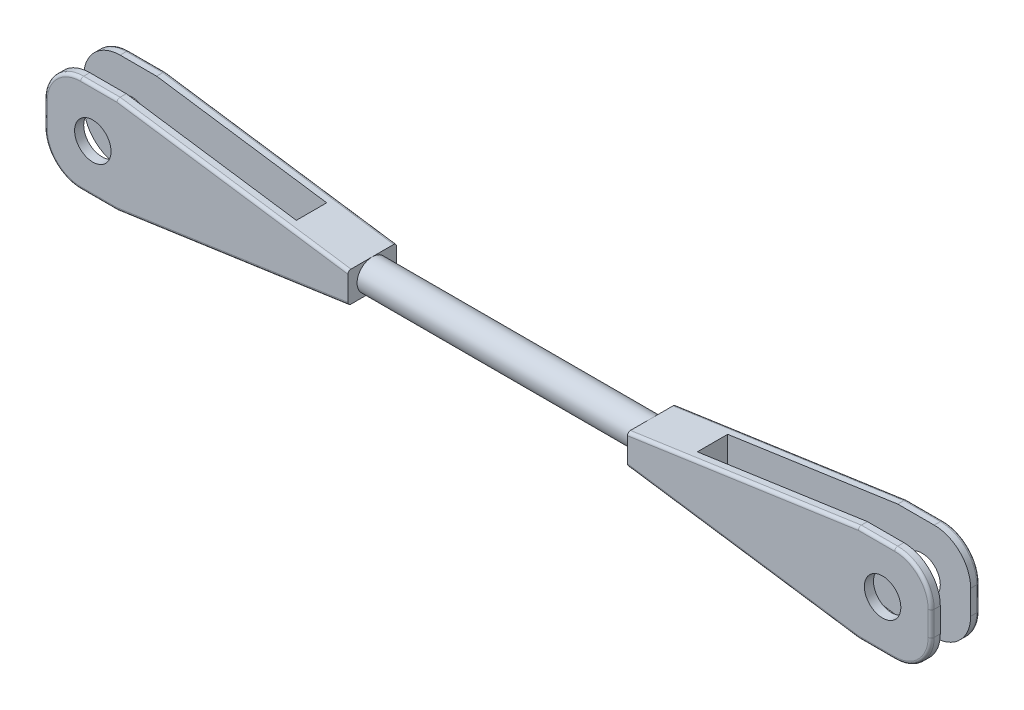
ISO-10303-21;
HEADER;
FILE_DESCRIPTION(('STEP AP214'),'2;1');
FILE_NAME('part.step','',(''),(''),'','','');
FILE_SCHEMA(('AUTOMOTIVE_DESIGN { 1 0 10303 214 1 1 1 1 }'));
ENDSEC;
DATA;
#1=APPLICATION_CONTEXT('core data for automotive mechanical design processes');
#2=APPLICATION_PROTOCOL_DEFINITION('international standard','automotive_design',2000,#1);
#3=PRODUCT_CONTEXT('',#1,'mechanical');
#4=PRODUCT('Part','Part','',(#3));
#5=PRODUCT_RELATED_PRODUCT_CATEGORY('part','',(#4));
#6=PRODUCT_DEFINITION_FORMATION('','',#4);
#7=PRODUCT_DEFINITION_CONTEXT('part definition',#1,'design');
#8=PRODUCT_DEFINITION('design','',#6,#7);
#9=PRODUCT_DEFINITION_SHAPE('','',#8);
#10=(LENGTH_UNIT() NAMED_UNIT(*) SI_UNIT(.MILLI.,.METRE.));
#11=(NAMED_UNIT(*) PLANE_ANGLE_UNIT() SI_UNIT($,.RADIAN.));
#12=(NAMED_UNIT(*) SI_UNIT($,.STERADIAN.) SOLID_ANGLE_UNIT());
#13=UNCERTAINTY_MEASURE_WITH_UNIT(LENGTH_MEASURE(1.E-05),#10,'distance_accuracy_value','');
#14=(GEOMETRIC_REPRESENTATION_CONTEXT(3) GLOBAL_UNCERTAINTY_ASSIGNED_CONTEXT((#13)) GLOBAL_UNIT_ASSIGNED_CONTEXT((#10,
#11,#12)) REPRESENTATION_CONTEXT('',''));
#15=CARTESIAN_POINT('',(0.,0.,0.));
#16=DIRECTION('',(0.,0.,1.));
#17=DIRECTION('',(1.,0.,0.));
#18=AXIS2_PLACEMENT_3D('',#15,#16,#17);
#19=CARTESIAN_POINT('',(420.,0.,40.));
#20=DIRECTION('',(-1.,0.,0.));
#21=DIRECTION('',(0.,0.,1.));
#22=AXIS2_PLACEMENT_3D('',#19,#20,#21);
#23=PLANE('',#22);
#24=DIRECTION('',(0.,1.,0.));
#25=VECTOR('',#24,1.);
#26=CARTESIAN_POINT('',(420.,0.,40.));
#27=LINE('',#26,#25);
#28=CARTESIAN_POINT('',(420.,-19.9478995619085,40.));
#29=VERTEX_POINT('',#28);
#30=CARTESIAN_POINT('',(420.,19.9478995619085,40.));
#31=VERTEX_POINT('',#30);
#32=EDGE_CURVE('E594',#29,#31,#27,.T.);
#33=ORIENTED_EDGE('',*,*,#32,.F.);
#34=CARTESIAN_POINT('',(420.,-19.9478995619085,35.));
#35=DIRECTION('',(-1.,0.,0.));
#36=DIRECTION('',(0.,1.,0.));
#37=AXIS2_PLACEMENT_3D('',#34,#35,#36);
#38=ELLIPSE('',#37,5.05210043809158,5.);
#39=CARTESIAN_POINT('',(420.,-25.0000000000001,35.));
#40=VERTEX_POINT('',#39);
#41=EDGE_CURVE('E42',#29,#40,#38,.F.);
#42=ORIENTED_EDGE('',*,*,#41,.T.);
#43=DIRECTION('',(0.,0.,-1.));
#44=VECTOR('',#43,1.);
#45=CARTESIAN_POINT('',(420.,-25.0000000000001,40.));
#46=LINE('',#45,#44);
#47=CARTESIAN_POINT('',(420.,-25.0000000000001,0.));
#48=VERTEX_POINT('',#47);
#49=EDGE_CURVE('E588',#40,#48,#46,.T.);
#50=ORIENTED_EDGE('',*,*,#49,.T.);
#51=CARTESIAN_POINT('',(420.,0.,0.));
#52=DIRECTION('',(1.,0.,0.));
#53=DIRECTION('',(0.,0.,-1.));
#54=AXIS2_PLACEMENT_3D('',#51,#52,#53);
#55=CIRCLE('',#54,25.);
#56=CARTESIAN_POINT('',(420.,25.,0.));
#57=VERTEX_POINT('',#56);
#58=EDGE_CURVE('E530',#57,#48,#55,.T.);
#59=ORIENTED_EDGE('',*,*,#58,.F.);
#60=DIRECTION('',(0.,0.,-1.));
#61=VECTOR('',#60,1.);
#62=CARTESIAN_POINT('',(420.,25.0000000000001,40.));
#63=LINE('',#62,#61);
#64=CARTESIAN_POINT('',(420.,25.0000000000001,35.));
#65=VERTEX_POINT('',#64);
#66=EDGE_CURVE('E603',#65,#57,#63,.T.);
#67=ORIENTED_EDGE('',*,*,#66,.F.);
#68=CARTESIAN_POINT('',(420.,19.9478995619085,35.));
#69=DIRECTION('',(-1.,0.,0.));
#70=DIRECTION('',(0.,1.,0.));
#71=AXIS2_PLACEMENT_3D('',#68,#69,#70);
#72=ELLIPSE('',#71,5.05210043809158,5.);
#73=EDGE_CURVE('E685',#65,#31,#72,.F.);
#74=ORIENTED_EDGE('',*,*,#73,.T.);
#75=EDGE_LOOP('',(#33,#42,#50,#59,#67,#74));
#76=FACE_BOUND('',#75,.T.);
#77=ADVANCED_FACE('F33',(#76),#23,.F.);
#78=CARTESIAN_POINT('',(420.,-25.0000000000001,-35.));
#79=VERTEX_POINT('',#78);
#80=EDGE_CURVE('E587',#48,#79,#46,.T.);
#81=ORIENTED_EDGE('',*,*,#80,.T.);
#82=CARTESIAN_POINT('',(420.,-19.9478995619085,-35.));
#83=DIRECTION('',(-1.,0.,0.));
#84=DIRECTION('',(0.,-1.,0.));
#85=AXIS2_PLACEMENT_3D('',#82,#83,#84);
#86=ELLIPSE('',#85,5.05210043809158,5.);
#87=CARTESIAN_POINT('',(420.,-19.9478995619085,-40.));
#88=VERTEX_POINT('',#87);
#89=EDGE_CURVE('E678',#79,#88,#86,.F.);
#90=ORIENTED_EDGE('',*,*,#89,.T.);
#91=DIRECTION('',(0.,1.,0.));
#92=VECTOR('',#91,1.);
#93=CARTESIAN_POINT('',(420.,0.,-40.));
#94=LINE('',#93,#92);
#95=CARTESIAN_POINT('',(420.,19.9478995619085,-40.));
#96=VERTEX_POINT('',#95);
#97=EDGE_CURVE('E593',#88,#96,#94,.T.);
#98=ORIENTED_EDGE('',*,*,#97,.T.);
#99=CARTESIAN_POINT('',(420.,19.9478995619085,-35.));
#100=DIRECTION('',(-1.,0.,0.));
#101=DIRECTION('',(0.,-1.,0.));
#102=AXIS2_PLACEMENT_3D('',#99,#100,#101);
#103=ELLIPSE('',#102,5.05210043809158,5.);
#104=CARTESIAN_POINT('',(420.,25.0000000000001,-35.));
#105=VERTEX_POINT('',#104);
#106=EDGE_CURVE('E676',#96,#105,#103,.F.);
#107=ORIENTED_EDGE('',*,*,#106,.T.);
#108=EDGE_CURVE('E602',#57,#105,#63,.T.);
#109=ORIENTED_EDGE('',*,*,#108,.F.);
#110=EDGE_CURVE('E535',#48,#57,#55,.T.);
#111=ORIENTED_EDGE('',*,*,#110,.F.);
#112=EDGE_LOOP('',(#81,#90,#98,#107,#109,#111));
#113=FACE_BOUND('',#112,.T.);
#114=ADVANCED_FACE('F782',(#113),#23,.F.);
#115=CARTESIAN_POINT('',(420.,25.0000000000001,40.));
#116=DIRECTION('',(-0.14324422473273,-0.989687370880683,0.));
#117=DIRECTION('',(0.989687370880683,-0.14324422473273,0.));
#118=AXIS2_PLACEMENT_3D('',#115,#116,#117);
#119=PLANE('',#118);
#120=ORIENTED_EDGE('',*,*,#108,.T.);
#121=DIRECTION('',(-0.989687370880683,0.14324422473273,0.));
#122=VECTOR('',#121,1.);
#123=CARTESIAN_POINT('',(40.,80.,-35.));
#124=LINE('',#123,#122);
#125=CARTESIAN_POINT('',(40.,80.,-35.));
#126=VERTEX_POINT('',#125);
#127=EDGE_CURVE('E683',#105,#126,#124,.T.);
#128=ORIENTED_EDGE('',*,*,#127,.T.);
#129=DIRECTION('',(0.,0.,-1.));
#130=VECTOR('',#129,1.);
#131=CARTESIAN_POINT('',(40.,80.,40.));
#132=LINE('',#131,#130);
#133=CARTESIAN_POINT('',(40.,80.,-25.));
#134=VERTEX_POINT('',#133);
#135=EDGE_CURVE('E597',#134,#126,#132,.T.);
#136=ORIENTED_EDGE('',*,*,#135,.F.);
#137=DIRECTION('',(0.989687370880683,-0.14324422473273,0.));
#138=VECTOR('',#137,1.);
#139=CARTESIAN_POINT('',(420.,25.0000000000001,-25.));
#140=LINE('',#139,#138);
#141=CARTESIAN_POINT('',(320.,39.4736842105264,-25.));
#142=VERTEX_POINT('',#141);
#143=EDGE_CURVE('E582',#134,#142,#140,.T.);
#144=ORIENTED_EDGE('',*,*,#143,.T.);
#145=DIRECTION('',(0.,0.,1.));
#146=VECTOR('',#145,1.);
#147=CARTESIAN_POINT('',(320.,39.4736842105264,40.));
#148=LINE('',#147,#146);
#149=CARTESIAN_POINT('',(320.,39.4736842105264,25.));
#150=VERTEX_POINT('',#149);
#151=EDGE_CURVE('E585',#142,#150,#148,.T.);
#152=ORIENTED_EDGE('',*,*,#151,.T.);
#153=DIRECTION('',(0.989687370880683,-0.14324422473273,0.));
#154=VECTOR('',#153,1.);
#155=CARTESIAN_POINT('',(420.,25.0000000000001,25.));
#156=LINE('',#155,#154);
#157=CARTESIAN_POINT('',(40.,80.,25.));
#158=VERTEX_POINT('',#157);
#159=EDGE_CURVE('E563',#158,#150,#156,.T.);
#160=ORIENTED_EDGE('',*,*,#159,.F.);
#161=CARTESIAN_POINT('',(40.,80.,35.));
#162=VERTEX_POINT('',#161);
#163=EDGE_CURVE('E600',#162,#158,#132,.T.);
#164=ORIENTED_EDGE('',*,*,#163,.F.);
#165=DIRECTION('',(-0.989687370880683,0.14324422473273,0.));
#166=VECTOR('',#165,1.);
#167=CARTESIAN_POINT('',(420.,25.0000000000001,35.));
#168=LINE('',#167,#166);
#169=EDGE_CURVE('E50',#162,#65,#168,.F.);
#170=ORIENTED_EDGE('',*,*,#169,.T.);
#171=ORIENTED_EDGE('',*,*,#66,.T.);
#172=EDGE_LOOP('',(#120,#128,#136,#144,#152,#160,#164,#170,#171));
#173=FACE_BOUND('',#172,.T.);
#174=ADVANCED_FACE('F787',(#173),#119,.F.);
#175=CARTESIAN_POINT('',(-80.,80.,40.));
#176=DIRECTION('',(0.,-1.,0.));
#177=DIRECTION('',(0.,0.,-1.));
#178=AXIS2_PLACEMENT_3D('',#175,#176,#177);
#179=PLANE('',#178);
#180=DIRECTION('',(0.,0.,-1.));
#181=VECTOR('',#180,1.);
#182=CARTESIAN_POINT('',(-20.,80.,40.));
#183=LINE('',#182,#181);
#184=CARTESIAN_POINT('',(-20.,80.,25.));
#185=VERTEX_POINT('',#184);
#186=CARTESIAN_POINT('',(-20.,80.,35.));
#187=VERTEX_POINT('',#186);
#188=EDGE_CURVE('E614',#185,#187,#183,.F.);
#189=ORIENTED_EDGE('',*,*,#188,.T.);
#190=DIRECTION('',(-1.,0.,0.));
#191=VECTOR('',#190,1.);
#192=CARTESIAN_POINT('',(-80.,80.,35.));
#193=LINE('',#192,#191);
#194=EDGE_CURVE('E11',#187,#162,#193,.F.);
#195=ORIENTED_EDGE('',*,*,#194,.T.);
#196=ORIENTED_EDGE('',*,*,#163,.T.);
#197=DIRECTION('',(-1.,0.,0.));
#198=VECTOR('',#197,1.);
#199=CARTESIAN_POINT('',(-80.,80.,25.));
#200=LINE('',#199,#198);
#201=EDGE_CURVE('E545',#158,#185,#200,.T.);
#202=ORIENTED_EDGE('',*,*,#201,.T.);
#203=EDGE_LOOP('',(#189,#195,#196,#202));
#204=FACE_BOUND('',#203,.T.);
#205=ADVANCED_FACE('F897',(#204),#179,.F.);
#206=CARTESIAN_POINT('',(-80.,0.,40.));
#207=DIRECTION('',(1.,0.,0.));
#208=DIRECTION('',(0.,0.,-1.));
#209=AXIS2_PLACEMENT_3D('',#206,#207,#208);
#210=PLANE('',#209);
#211=DIRECTION('',(0.,0.,-1.));
#212=VECTOR('',#211,1.);
#213=CARTESIAN_POINT('',(-80.,-20.,40.));
#214=LINE('',#213,#212);
#215=CARTESIAN_POINT('',(-80.,-20.,25.));
#216=VERTEX_POINT('',#215);
#217=CARTESIAN_POINT('',(-80.,-20.,35.));
#218=VERTEX_POINT('',#217);
#219=EDGE_CURVE('E611',#216,#218,#214,.F.);
#220=ORIENTED_EDGE('',*,*,#219,.T.);
#221=DIRECTION('',(0.,-1.,0.));
#222=VECTOR('',#221,1.);
#223=CARTESIAN_POINT('',(-80.,0.,35.));
#224=LINE('',#223,#222);
#225=CARTESIAN_POINT('',(-80.,20.,35.));
#226=VERTEX_POINT('',#225);
#227=EDGE_CURVE('E668',#218,#226,#224,.F.);
#228=ORIENTED_EDGE('',*,*,#227,.T.);
#229=DIRECTION('',(0.,0.,-1.));
#230=VECTOR('',#229,1.);
#231=CARTESIAN_POINT('',(-80.,20.,40.));
#232=LINE('',#231,#230);
#233=CARTESIAN_POINT('',(-80.,20.,25.));
#234=VERTEX_POINT('',#233);
#235=EDGE_CURVE('E609',#226,#234,#232,.T.);
#236=ORIENTED_EDGE('',*,*,#235,.T.);
#237=DIRECTION('',(0.,1.,0.));
#238=VECTOR('',#237,1.);
#239=CARTESIAN_POINT('',(-80.,-80.,25.));
#240=LINE('',#239,#238);
#241=EDGE_CURVE('E549',#216,#234,#240,.T.);
#242=ORIENTED_EDGE('',*,*,#241,.F.);
#243=EDGE_LOOP('',(#220,#228,#236,#242));
#244=FACE_BOUND('',#243,.T.);
#245=ADVANCED_FACE('F758',(#244),#210,.F.);
#246=CARTESIAN_POINT('',(-80.,-80.,40.));
#247=DIRECTION('',(0.,-1.,0.));
#248=DIRECTION('',(0.,0.,-1.));
#249=AXIS2_PLACEMENT_3D('',#246,#247,#248);
#250=PLANE('',#249);
#251=DIRECTION('',(0.,0.,-1.));
#252=VECTOR('',#251,1.);
#253=CARTESIAN_POINT('',(40.,-80.,40.));
#254=LINE('',#253,#252);
#255=CARTESIAN_POINT('',(40.,-80.,35.));
#256=VERTEX_POINT('',#255);
#257=CARTESIAN_POINT('',(40.,-80.,25.));
#258=VERTEX_POINT('',#257);
#259=EDGE_CURVE('E591',#256,#258,#254,.T.);
#260=ORIENTED_EDGE('',*,*,#259,.F.);
#261=DIRECTION('',(-1.,0.,0.));
#262=VECTOR('',#261,1.);
#263=CARTESIAN_POINT('',(-20.,-80.,35.));
#264=LINE('',#263,#262);
#265=CARTESIAN_POINT('',(-20.,-80.,35.));
#266=VERTEX_POINT('',#265);
#267=EDGE_CURVE('E649',#256,#266,#264,.T.);
#268=ORIENTED_EDGE('',*,*,#267,.T.);
#269=DIRECTION('',(0.,0.,-1.));
#270=VECTOR('',#269,1.);
#271=CARTESIAN_POINT('',(-20.,-80.,-40.));
#272=LINE('',#271,#270);
#273=CARTESIAN_POINT('',(-20.,-80.,25.));
#274=VERTEX_POINT('',#273);
#275=EDGE_CURVE('E606',#266,#274,#272,.T.);
#276=ORIENTED_EDGE('',*,*,#275,.T.);
#277=DIRECTION('',(-1.,0.,0.));
#278=VECTOR('',#277,1.);
#279=CARTESIAN_POINT('',(-80.,-80.,25.));
#280=LINE('',#279,#278);
#281=EDGE_CURVE('E546',#258,#274,#280,.T.);
#282=ORIENTED_EDGE('',*,*,#281,.F.);
#283=EDGE_LOOP('',(#260,#268,#276,#282));
#284=FACE_BOUND('',#283,.T.);
#285=ADVANCED_FACE('F747',(#284),#250,.T.);
#286=CARTESIAN_POINT('',(420.,-25.0000000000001,40.));
#287=DIRECTION('',(0.14324422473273,-0.989687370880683,0.));
#288=DIRECTION('',(0.989687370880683,0.14324422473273,0.));
#289=AXIS2_PLACEMENT_3D('',#286,#287,#288);
#290=PLANE('',#289);
#291=CARTESIAN_POINT('',(40.,-80.,-25.));
#292=VERTEX_POINT('',#291);
#293=CARTESIAN_POINT('',(40.,-80.,-35.));
#294=VERTEX_POINT('',#293);
#295=EDGE_CURVE('E590',#292,#294,#254,.T.);
#296=ORIENTED_EDGE('',*,*,#295,.T.);
#297=DIRECTION('',(-0.989687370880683,-0.14324422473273,0.));
#298=VECTOR('',#297,1.);
#299=CARTESIAN_POINT('',(420.,-25.0000000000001,-35.));
#300=LINE('',#299,#298);
#301=EDGE_CURVE('E674',#294,#79,#300,.F.);
#302=ORIENTED_EDGE('',*,*,#301,.T.);
#303=ORIENTED_EDGE('',*,*,#80,.F.);
#304=ORIENTED_EDGE('',*,*,#49,.F.);
#305=DIRECTION('',(-0.989687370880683,-0.14324422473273,0.));
#306=VECTOR('',#305,1.);
#307=CARTESIAN_POINT('',(40.,-80.,35.));
#308=LINE('',#307,#306);
#309=EDGE_CURVE('E672',#40,#256,#308,.T.);
#310=ORIENTED_EDGE('',*,*,#309,.T.);
#311=ORIENTED_EDGE('',*,*,#259,.T.);
#312=DIRECTION('',(0.989687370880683,0.14324422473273,0.));
#313=VECTOR('',#312,1.);
#314=CARTESIAN_POINT('',(420.,-25.0000000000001,25.));
#315=LINE('',#314,#313);
#316=CARTESIAN_POINT('',(320.,-39.4736842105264,25.));
#317=VERTEX_POINT('',#316);
#318=EDGE_CURVE('E560',#258,#317,#315,.T.);
#319=ORIENTED_EDGE('',*,*,#318,.T.);
#320=DIRECTION('',(0.,0.,1.));
#321=VECTOR('',#320,1.);
#322=CARTESIAN_POINT('',(320.,-39.4736842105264,40.));
#323=LINE('',#322,#321);
#324=CARTESIAN_POINT('',(320.,-39.4736842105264,-25.));
#325=VERTEX_POINT('',#324);
#326=EDGE_CURVE('E619',#325,#317,#323,.T.);
#327=ORIENTED_EDGE('',*,*,#326,.F.);
#328=DIRECTION('',(0.989687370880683,0.14324422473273,0.));
#329=VECTOR('',#328,1.);
#330=CARTESIAN_POINT('',(420.,-25.0000000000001,-25.));
#331=LINE('',#330,#329);
#332=EDGE_CURVE('E580',#292,#325,#331,.T.);
#333=ORIENTED_EDGE('',*,*,#332,.F.);
#334=EDGE_LOOP('',(#296,#302,#303,#304,#310,#311,#319,#327,#333));
#335=FACE_BOUND('',#334,.T.);
#336=ADVANCED_FACE('F794',(#335),#290,.T.);
#337=CARTESIAN_POINT('',(-20.,-20.,40.));
#338=DIRECTION('',(0.,0.,1.));
#339=DIRECTION('',(1.,0.,0.));
#340=AXIS2_PLACEMENT_3D('',#337,#338,#339);
#341=CYLINDRICAL_SURFACE('',#340,60.);
#342=ORIENTED_EDGE('',*,*,#275,.F.);
#343=CARTESIAN_POINT('',(-20.,-20.,35.));
#344=DIRECTION('',(0.,0.,-1.));
#345=DIRECTION('',(-1.,0.,0.));
#346=AXIS2_PLACEMENT_3D('',#343,#344,#345);
#347=CIRCLE('',#346,60.);
#348=EDGE_CURVE('E666',#266,#218,#347,.T.);
#349=ORIENTED_EDGE('',*,*,#348,.T.);
#350=ORIENTED_EDGE('',*,*,#219,.F.);
#351=CARTESIAN_POINT('',(-20.,-20.,25.));
#352=DIRECTION('',(0.,0.,-1.));
#353=DIRECTION('',(-1.,0.,0.));
#354=AXIS2_PLACEMENT_3D('',#351,#352,#353);
#355=CIRCLE('',#354,60.);
#356=EDGE_CURVE('E555',#216,#274,#355,.F.);
#357=ORIENTED_EDGE('',*,*,#356,.T.);
#358=EDGE_LOOP('',(#342,#349,#350,#357));
#359=FACE_BOUND('',#358,.T.);
#360=ADVANCED_FACE('F750',(#359),#341,.T.);
#361=CARTESIAN_POINT('',(-20.,20.,40.));
#362=DIRECTION('',(0.,0.,-1.));
#363=DIRECTION('',(-1.,0.,0.));
#364=AXIS2_PLACEMENT_3D('',#361,#362,#363);
#365=CYLINDRICAL_SURFACE('',#364,60.);
#366=ORIENTED_EDGE('',*,*,#235,.F.);
#367=CARTESIAN_POINT('',(-20.,20.,35.));
#368=DIRECTION('',(0.,0.,-1.));
#369=DIRECTION('',(-1.,0.,0.));
#370=AXIS2_PLACEMENT_3D('',#367,#368,#369);
#371=CIRCLE('',#370,60.);
#372=EDGE_CURVE('E670',#226,#187,#371,.T.);
#373=ORIENTED_EDGE('',*,*,#372,.T.);
#374=ORIENTED_EDGE('',*,*,#188,.F.);
#375=CARTESIAN_POINT('',(-20.,20.,25.));
#376=DIRECTION('',(0.,0.,-1.));
#377=DIRECTION('',(-1.,0.,0.));
#378=AXIS2_PLACEMENT_3D('',#375,#376,#377);
#379=CIRCLE('',#378,60.);
#380=EDGE_CURVE('E621',#185,#234,#379,.F.);
#381=ORIENTED_EDGE('',*,*,#380,.T.);
#382=EDGE_LOOP('',(#366,#373,#374,#381));
#383=FACE_BOUND('',#382,.T.);
#384=ADVANCED_FACE('F762',(#383),#365,.T.);
#385=ORIENTED_EDGE('',*,*,#135,.T.);
#386=DIRECTION('',(-1.,0.,0.));
#387=VECTOR('',#386,1.);
#388=CARTESIAN_POINT('',(-20.,80.,-35.));
#389=LINE('',#388,#387);
#390=CARTESIAN_POINT('',(-20.,80.,-35.));
#391=VERTEX_POINT('',#390);
#392=EDGE_CURVE('E680',#126,#391,#389,.T.);
#393=ORIENTED_EDGE('',*,*,#392,.T.);
#394=CARTESIAN_POINT('',(-20.,80.,-25.));
#395=VERTEX_POINT('',#394);
#396=EDGE_CURVE('E615',#391,#395,#183,.F.);
#397=ORIENTED_EDGE('',*,*,#396,.T.);
#398=DIRECTION('',(-1.,0.,0.));
#399=VECTOR('',#398,1.);
#400=CARTESIAN_POINT('',(-80.,80.,-25.));
#401=LINE('',#400,#399);
#402=EDGE_CURVE('E566',#134,#395,#401,.T.);
#403=ORIENTED_EDGE('',*,*,#402,.F.);
#404=EDGE_LOOP('',(#385,#393,#397,#403));
#405=FACE_BOUND('',#404,.T.);
#406=ADVANCED_FACE('F798',(#405),#179,.F.);
#407=CARTESIAN_POINT('',(-80.,20.,-25.));
#408=VERTEX_POINT('',#407);
#409=CARTESIAN_POINT('',(-80.,20.,-35.));
#410=VERTEX_POINT('',#409);
#411=EDGE_CURVE('E608',#408,#410,#232,.T.);
#412=ORIENTED_EDGE('',*,*,#411,.T.);
#413=DIRECTION('',(0.,-1.,0.));
#414=VECTOR('',#413,1.);
#415=CARTESIAN_POINT('',(-80.,-20.,-35.));
#416=LINE('',#415,#414);
#417=CARTESIAN_POINT('',(-80.,-20.,-35.));
#418=VERTEX_POINT('',#417);
#419=EDGE_CURVE('E645',#410,#418,#416,.T.);
#420=ORIENTED_EDGE('',*,*,#419,.T.);
#421=CARTESIAN_POINT('',(-80.,-20.,-25.));
#422=VERTEX_POINT('',#421);
#423=EDGE_CURVE('E612',#418,#422,#214,.F.);
#424=ORIENTED_EDGE('',*,*,#423,.T.);
#425=DIRECTION('',(0.,1.,0.));
#426=VECTOR('',#425,1.);
#427=CARTESIAN_POINT('',(-80.,-80.,-25.));
#428=LINE('',#427,#426);
#429=EDGE_CURVE('E573',#422,#408,#428,.T.);
#430=ORIENTED_EDGE('',*,*,#429,.T.);
#431=EDGE_LOOP('',(#412,#420,#424,#430));
#432=FACE_BOUND('',#431,.T.);
#433=ADVANCED_FACE('F859',(#432),#210,.F.);
#434=CARTESIAN_POINT('',(-20.,-80.,-25.));
#435=VERTEX_POINT('',#434);
#436=CARTESIAN_POINT('',(-20.,-80.,-35.));
#437=VERTEX_POINT('',#436);
#438=EDGE_CURVE('E605',#435,#437,#272,.T.);
#439=ORIENTED_EDGE('',*,*,#438,.T.);
#440=DIRECTION('',(-1.,0.,0.));
#441=VECTOR('',#440,1.);
#442=CARTESIAN_POINT('',(-80.,-80.,-35.));
#443=LINE('',#442,#441);
#444=EDGE_CURVE('E641',#437,#294,#443,.F.);
#445=ORIENTED_EDGE('',*,*,#444,.T.);
#446=ORIENTED_EDGE('',*,*,#295,.F.);
#447=DIRECTION('',(-1.,0.,0.));
#448=VECTOR('',#447,1.);
#449=CARTESIAN_POINT('',(-80.,-80.,-25.));
#450=LINE('',#449,#448);
#451=EDGE_CURVE('E567',#292,#435,#450,.T.);
#452=ORIENTED_EDGE('',*,*,#451,.T.);
#453=EDGE_LOOP('',(#439,#445,#446,#452));
#454=FACE_BOUND('',#453,.T.);
#455=ADVANCED_FACE('F872',(#454),#250,.T.);
#456=ORIENTED_EDGE('',*,*,#423,.F.);
#457=CARTESIAN_POINT('',(-20.,-20.,-35.));
#458=DIRECTION('',(0.,0.,-1.));
#459=DIRECTION('',(-1.,0.,0.));
#460=AXIS2_PLACEMENT_3D('',#457,#458,#459);
#461=CIRCLE('',#460,60.);
#462=EDGE_CURVE('E643',#418,#437,#461,.F.);
#463=ORIENTED_EDGE('',*,*,#462,.T.);
#464=ORIENTED_EDGE('',*,*,#438,.F.);
#465=CARTESIAN_POINT('',(-20.,-20.,-25.));
#466=DIRECTION('',(0.,0.,-1.));
#467=DIRECTION('',(-1.,0.,0.));
#468=AXIS2_PLACEMENT_3D('',#465,#466,#467);
#469=CIRCLE('',#468,60.);
#470=EDGE_CURVE('E576',#422,#435,#469,.F.);
#471=ORIENTED_EDGE('',*,*,#470,.F.);
#472=EDGE_LOOP('',(#456,#463,#464,#471));
#473=FACE_BOUND('',#472,.T.);
#474=ADVANCED_FACE('F795',(#473),#341,.T.);
#475=ORIENTED_EDGE('',*,*,#396,.F.);
#476=CARTESIAN_POINT('',(-20.,20.,-35.));
#477=DIRECTION('',(0.,0.,-1.));
#478=DIRECTION('',(-1.,0.,0.));
#479=AXIS2_PLACEMENT_3D('',#476,#477,#478);
#480=CIRCLE('',#479,60.);
#481=EDGE_CURVE('E647',#391,#410,#480,.F.);
#482=ORIENTED_EDGE('',*,*,#481,.T.);
#483=ORIENTED_EDGE('',*,*,#411,.F.);
#484=CARTESIAN_POINT('',(-20.,20.,-25.));
#485=DIRECTION('',(0.,0.,-1.));
#486=DIRECTION('',(-1.,0.,0.));
#487=AXIS2_PLACEMENT_3D('',#484,#485,#486);
#488=CIRCLE('',#487,60.);
#489=EDGE_CURVE('E617',#395,#408,#488,.F.);
#490=ORIENTED_EDGE('',*,*,#489,.F.);
#491=EDGE_LOOP('',(#475,#482,#483,#490));
#492=FACE_BOUND('',#491,.T.);
#493=ADVANCED_FACE('F799',(#492),#365,.T.);
#494=CARTESIAN_POINT('',(-80.,0.,40.));
#495=DIRECTION('',(0.,0.,-1.));
#496=DIRECTION('',(-1.,0.,0.));
#497=AXIS2_PLACEMENT_3D('',#494,#495,#496);
#498=PLANE('',#497);
#499=CARTESIAN_POINT('',(0.,0.,40.));
#500=DIRECTION('',(0.,0.,1.));
#501=DIRECTION('',(1.,0.,0.));
#502=AXIS2_PLACEMENT_3D('',#499,#500,#501);
#503=CIRCLE('',#502,30.);
#504=CARTESIAN_POINT('',(30.,0.,40.));
#505=VERTEX_POINT('',#504);
#506=EDGE_CURVE('E533',#505,#505,#503,.T.);
#507=ORIENTED_EDGE('',*,*,#506,.F.);
#508=EDGE_LOOP('',(#507));
#509=FACE_BOUND('',#508,.T.);
#510=DIRECTION('',(-1.,0.,0.));
#511=VECTOR('',#510,1.);
#512=CARTESIAN_POINT('',(40.,-75.,40.));
#513=LINE('',#512,#511);
#514=CARTESIAN_POINT('',(-20.,-75.,40.));
#515=VERTEX_POINT('',#514);
#516=CARTESIAN_POINT('',(39.6400333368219,-75.,40.));
#517=VERTEX_POINT('',#516);
#518=EDGE_CURVE('E662',#515,#517,#513,.F.);
#519=ORIENTED_EDGE('',*,*,#518,.T.);
#520=DIRECTION('',(-0.989687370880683,-0.14324422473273,0.));
#521=VECTOR('',#520,1.);
#522=CARTESIAN_POINT('',(419.283778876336,-20.0515631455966,40.));
#523=LINE('',#522,#521);
#524=EDGE_CURVE('E664',#517,#29,#523,.F.);
#525=ORIENTED_EDGE('',*,*,#524,.T.);
#526=ORIENTED_EDGE('',*,*,#32,.T.);
#527=DIRECTION('',(-0.989687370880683,0.14324422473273,0.));
#528=VECTOR('',#527,1.);
#529=CARTESIAN_POINT('',(-66.9125921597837,90.4220905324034,40.));
#530=LINE('',#529,#528);
#531=CARTESIAN_POINT('',(39.6400333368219,75.,40.));
#532=VERTEX_POINT('',#531);
#533=EDGE_CURVE('E652',#31,#532,#530,.T.);
#534=ORIENTED_EDGE('',*,*,#533,.T.);
#535=DIRECTION('',(-1.,0.,0.));
#536=VECTOR('',#535,1.);
#537=CARTESIAN_POINT('',(-80.,75.,40.));
#538=LINE('',#537,#536);
#539=CARTESIAN_POINT('',(-20.,75.,40.));
#540=VERTEX_POINT('',#539);
#541=EDGE_CURVE('E654',#532,#540,#538,.T.);
#542=ORIENTED_EDGE('',*,*,#541,.T.);
#543=CARTESIAN_POINT('',(-20.,20.,40.));
#544=DIRECTION('',(0.,0.,-1.));
#545=DIRECTION('',(-1.,0.,0.));
#546=AXIS2_PLACEMENT_3D('',#543,#544,#545);
#547=CIRCLE('',#546,55.);
#548=CARTESIAN_POINT('',(-75.,20.,40.));
#549=VERTEX_POINT('',#548);
#550=EDGE_CURVE('E656',#540,#549,#547,.F.);
#551=ORIENTED_EDGE('',*,*,#550,.T.);
#552=DIRECTION('',(0.,-1.,0.));
#553=VECTOR('',#552,1.);
#554=CARTESIAN_POINT('',(-75.,0.,40.));
#555=LINE('',#554,#553);
#556=CARTESIAN_POINT('',(-75.,-20.,40.));
#557=VERTEX_POINT('',#556);
#558=EDGE_CURVE('E658',#549,#557,#555,.T.);
#559=ORIENTED_EDGE('',*,*,#558,.T.);
#560=CARTESIAN_POINT('',(-20.,-20.,40.));
#561=DIRECTION('',(0.,0.,-1.));
#562=DIRECTION('',(-1.,0.,0.));
#563=AXIS2_PLACEMENT_3D('',#560,#561,#562);
#564=CIRCLE('',#563,55.);
#565=EDGE_CURVE('E660',#557,#515,#564,.F.);
#566=ORIENTED_EDGE('',*,*,#565,.T.);
#567=EDGE_LOOP('',(#519,#525,#526,#534,#542,#551,#559,#566));
#568=FACE_BOUND('',#567,.T.);
#569=ADVANCED_FACE('F732',(#509,#568),#498,.F.);
#570=CARTESIAN_POINT('',(-80.,0.,-40.));
#571=DIRECTION('',(0.,0.,-1.));
#572=DIRECTION('',(-1.,0.,0.));
#573=AXIS2_PLACEMENT_3D('',#570,#571,#572);
#574=PLANE('',#573);
#575=CARTESIAN_POINT('',(0.,0.,-40.));
#576=DIRECTION('',(0.,0.,1.));
#577=DIRECTION('',(1.,0.,0.));
#578=AXIS2_PLACEMENT_3D('',#575,#576,#577);
#579=CIRCLE('',#578,30.);
#580=CARTESIAN_POINT('',(30.,0.,-40.));
#581=VERTEX_POINT('',#580);
#582=EDGE_CURVE('E536',#581,#581,#579,.T.);
#583=ORIENTED_EDGE('',*,*,#582,.T.);
#584=EDGE_LOOP('',(#583));
#585=FACE_BOUND('',#584,.T.);
#586=ORIENTED_EDGE('',*,*,#97,.F.);
#587=DIRECTION('',(-0.989687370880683,-0.14324422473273,0.));
#588=VECTOR('',#587,1.);
#589=CARTESIAN_POINT('',(-66.9125921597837,-90.4220905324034,-40.));
#590=LINE('',#589,#588);
#591=CARTESIAN_POINT('',(39.6400333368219,-75.,-40.));
#592=VERTEX_POINT('',#591);
#593=EDGE_CURVE('E639',#88,#592,#590,.T.);
#594=ORIENTED_EDGE('',*,*,#593,.T.);
#595=DIRECTION('',(-1.,0.,0.));
#596=VECTOR('',#595,1.);
#597=CARTESIAN_POINT('',(-80.,-75.,-40.));
#598=LINE('',#597,#596);
#599=CARTESIAN_POINT('',(-20.,-75.,-40.));
#600=VERTEX_POINT('',#599);
#601=EDGE_CURVE('E636',#592,#600,#598,.T.);
#602=ORIENTED_EDGE('',*,*,#601,.T.);
#603=CARTESIAN_POINT('',(-20.,-20.,-40.));
#604=DIRECTION('',(0.,0.,-1.));
#605=DIRECTION('',(-1.,0.,0.));
#606=AXIS2_PLACEMENT_3D('',#603,#604,#605);
#607=CIRCLE('',#606,55.);
#608=CARTESIAN_POINT('',(-75.,-20.,-40.));
#609=VERTEX_POINT('',#608);
#610=EDGE_CURVE('E634',#600,#609,#607,.T.);
#611=ORIENTED_EDGE('',*,*,#610,.T.);
#612=DIRECTION('',(0.,-1.,0.));
#613=VECTOR('',#612,1.);
#614=CARTESIAN_POINT('',(-75.,20.,-40.));
#615=LINE('',#614,#613);
#616=CARTESIAN_POINT('',(-75.,20.,-40.));
#617=VERTEX_POINT('',#616);
#618=EDGE_CURVE('E632',#609,#617,#615,.F.);
#619=ORIENTED_EDGE('',*,*,#618,.T.);
#620=CARTESIAN_POINT('',(-20.,20.,-40.));
#621=DIRECTION('',(0.,0.,-1.));
#622=DIRECTION('',(-1.,0.,0.));
#623=AXIS2_PLACEMENT_3D('',#620,#621,#622);
#624=CIRCLE('',#623,55.);
#625=CARTESIAN_POINT('',(-20.,75.,-40.));
#626=VERTEX_POINT('',#625);
#627=EDGE_CURVE('E630',#617,#626,#624,.T.);
#628=ORIENTED_EDGE('',*,*,#627,.T.);
#629=DIRECTION('',(-1.,0.,0.));
#630=VECTOR('',#629,1.);
#631=CARTESIAN_POINT('',(40.,75.,-40.));
#632=LINE('',#631,#630);
#633=CARTESIAN_POINT('',(39.6400333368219,75.,-40.));
#634=VERTEX_POINT('',#633);
#635=EDGE_CURVE('E628',#626,#634,#632,.F.);
#636=ORIENTED_EDGE('',*,*,#635,.T.);
#637=DIRECTION('',(-0.989687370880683,0.14324422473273,0.));
#638=VECTOR('',#637,1.);
#639=CARTESIAN_POINT('',(419.283778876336,20.0515631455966,-40.));
#640=LINE('',#639,#638);
#641=EDGE_CURVE('E626',#634,#96,#640,.F.);
#642=ORIENTED_EDGE('',*,*,#641,.T.);
#643=EDGE_LOOP('',(#586,#594,#602,#611,#619,#628,#636,#642));
#644=FACE_BOUND('',#643,.T.);
#645=ADVANCED_FACE('F881',(#585,#644),#574,.T.);
#646=CARTESIAN_POINT('',(320.,-80.,0.));
#647=DIRECTION('',(1.,0.,0.));
#648=DIRECTION('',(0.,0.,-1.));
#649=AXIS2_PLACEMENT_3D('',#646,#647,#648);
#650=PLANE('',#649);
#651=DIRECTION('',(0.,1.,0.));
#652=VECTOR('',#651,1.);
#653=CARTESIAN_POINT('',(320.,-80.,-25.));
#654=LINE('',#653,#652);
#655=EDGE_CURVE('E570',#325,#142,#654,.T.);
#656=ORIENTED_EDGE('',*,*,#655,.F.);
#657=ORIENTED_EDGE('',*,*,#326,.T.);
#658=DIRECTION('',(0.,1.,0.));
#659=VECTOR('',#658,1.);
#660=CARTESIAN_POINT('',(320.,-80.,25.));
#661=LINE('',#660,#659);
#662=EDGE_CURVE('E552',#317,#150,#661,.T.);
#663=ORIENTED_EDGE('',*,*,#662,.T.);
#664=ORIENTED_EDGE('',*,*,#151,.F.);
#665=EDGE_LOOP('',(#656,#657,#663,#664));
#666=FACE_BOUND('',#665,.T.);
#667=ADVANCED_FACE('F896',(#666),#650,.F.);
#668=CARTESIAN_POINT('',(-80.,-80.,-25.));
#669=DIRECTION('',(0.,0.,-1.));
#670=DIRECTION('',(-1.,0.,0.));
#671=AXIS2_PLACEMENT_3D('',#668,#669,#670);
#672=PLANE('',#671);
#673=CARTESIAN_POINT('',(0.,0.,-25.));
#674=DIRECTION('',(0.,0.,-1.));
#675=DIRECTION('',(-1.,0.,0.));
#676=AXIS2_PLACEMENT_3D('',#673,#674,#675);
#677=CIRCLE('',#676,30.);
#678=CARTESIAN_POINT('',(-30.,0.,-25.));
#679=VERTEX_POINT('',#678);
#680=EDGE_CURVE('E542',#679,#679,#677,.T.);
#681=ORIENTED_EDGE('',*,*,#680,.T.);
#682=EDGE_LOOP('',(#681));
#683=FACE_BOUND('',#682,.T.);
#684=ORIENTED_EDGE('',*,*,#402,.T.);
#685=ORIENTED_EDGE('',*,*,#489,.T.);
#686=ORIENTED_EDGE('',*,*,#429,.F.);
#687=ORIENTED_EDGE('',*,*,#470,.T.);
#688=ORIENTED_EDGE('',*,*,#451,.F.);
#689=ORIENTED_EDGE('',*,*,#332,.T.);
#690=ORIENTED_EDGE('',*,*,#655,.T.);
#691=ORIENTED_EDGE('',*,*,#143,.F.);
#692=EDGE_LOOP('',(#684,#685,#686,#687,#688,#689,#690,#691));
#693=FACE_BOUND('',#692,.T.);
#694=ADVANCED_FACE('F864',(#683,#693),#672,.F.);
#695=CARTESIAN_POINT('',(-80.,-80.,25.));
#696=DIRECTION('',(0.,0.,-1.));
#697=DIRECTION('',(-1.,0.,0.));
#698=AXIS2_PLACEMENT_3D('',#695,#696,#697);
#699=PLANE('',#698);
#700=CARTESIAN_POINT('',(0.,0.,25.));
#701=DIRECTION('',(0.,0.,-1.));
#702=DIRECTION('',(-1.,0.,0.));
#703=AXIS2_PLACEMENT_3D('',#700,#701,#702);
#704=CIRCLE('',#703,30.);
#705=CARTESIAN_POINT('',(-30.,0.,25.));
#706=VERTEX_POINT('',#705);
#707=EDGE_CURVE('E539',#706,#706,#704,.T.);
#708=ORIENTED_EDGE('',*,*,#707,.F.);
#709=EDGE_LOOP('',(#708));
#710=FACE_BOUND('',#709,.T.);
#711=ORIENTED_EDGE('',*,*,#159,.T.);
#712=ORIENTED_EDGE('',*,*,#662,.F.);
#713=ORIENTED_EDGE('',*,*,#318,.F.);
#714=ORIENTED_EDGE('',*,*,#281,.T.);
#715=ORIENTED_EDGE('',*,*,#356,.F.);
#716=ORIENTED_EDGE('',*,*,#241,.T.);
#717=ORIENTED_EDGE('',*,*,#380,.F.);
#718=ORIENTED_EDGE('',*,*,#201,.F.);
#719=EDGE_LOOP('',(#711,#712,#713,#714,#715,#716,#717,#718));
#720=FACE_BOUND('',#719,.T.);
#721=ADVANCED_FACE('F755',(#710,#720),#699,.T.);
#722=CARTESIAN_POINT('',(0.,0.,-40.));
#723=DIRECTION('',(0.,0.,1.));
#724=DIRECTION('',(1.,0.,0.));
#725=AXIS2_PLACEMENT_3D('',#722,#723,#724);
#726=CYLINDRICAL_SURFACE('',#725,30.);
#727=ORIENTED_EDGE('',*,*,#707,.T.);
#728=EDGE_LOOP('',(#727));
#729=FACE_BOUND('',#728,.T.);
#730=ORIENTED_EDGE('',*,*,#506,.T.);
#731=EDGE_LOOP('',(#730));
#732=FACE_BOUND('',#731,.T.);
#733=ADVANCED_FACE('F929',(#729,#732),#726,.F.);
#734=ORIENTED_EDGE('',*,*,#582,.F.);
#735=EDGE_LOOP('',(#734));
#736=FACE_BOUND('',#735,.T.);
#737=ORIENTED_EDGE('',*,*,#680,.F.);
#738=EDGE_LOOP('',(#737));
#739=FACE_BOUND('',#738,.T.);
#740=ADVANCED_FACE('F830',(#736,#739),#726,.F.);
#741=CARTESIAN_POINT('',(650.,0.,0.));
#742=DIRECTION('',(-1.,0.,0.));
#743=DIRECTION('',(0.,0.,1.));
#744=AXIS2_PLACEMENT_3D('',#741,#742,#743);
#745=CYLINDRICAL_SURFACE('',#744,25.);
#746=ORIENTED_EDGE('',*,*,#58,.T.);
#747=ORIENTED_EDGE('',*,*,#110,.T.);
#748=EDGE_LOOP('',(#746,#747));
#749=FACE_BOUND('',#748,.T.);
#750=CARTESIAN_POINT('',(880.,0.,0.));
#751=DIRECTION('',(1.,0.,0.));
#752=DIRECTION('',(0.,0.,-1.));
#753=AXIS2_PLACEMENT_3D('',#750,#751,#752);
#754=CIRCLE('',#753,25.);
#755=CARTESIAN_POINT('',(880.,25.,0.));
#756=VERTEX_POINT('',#755);
#757=CARTESIAN_POINT('',(880.,-25.0000000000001,0.));
#758=VERTEX_POINT('',#757);
#759=EDGE_CURVE('E378',#756,#758,#754,.T.);
#760=ORIENTED_EDGE('',*,*,#759,.F.);
#761=EDGE_CURVE('E367',#758,#756,#754,.T.);
#762=ORIENTED_EDGE('',*,*,#761,.F.);
#763=EDGE_LOOP('',(#760,#762));
#764=FACE_BOUND('',#763,.T.);
#765=ADVANCED_FACE('F380',(#749,#764),#745,.T.);
#766=CARTESIAN_POINT('',(419.283778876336,20.0515631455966,-35.));
#767=DIRECTION('',(0.989687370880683,-0.14324422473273,0.));
#768=DIRECTION('',(0.14324422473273,0.989687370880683,0.));
#769=AXIS2_PLACEMENT_3D('',#766,#767,#768);
#770=CYLINDRICAL_SURFACE('',#769,5.);
#771=ORIENTED_EDGE('',*,*,#106,.F.);
#772=ORIENTED_EDGE('',*,*,#641,.F.);
#773=CARTESIAN_POINT('',(39.640033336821,75.0000000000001,-35.));
#774=DIRECTION('',(0.997418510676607,-0.0718074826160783,0.));
#775=DIRECTION('',(-0.0718074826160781,-0.997418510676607,0.));
#776=AXIS2_PLACEMENT_3D('',#773,#774,#775);
#777=ELLIPSE('',#776,5.01294085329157,5.);
#778=EDGE_CURVE('E534',#126,#634,#777,.F.);
#779=ORIENTED_EDGE('',*,*,#778,.F.);
#780=ORIENTED_EDGE('',*,*,#127,.F.);
#781=EDGE_LOOP('',(#771,#772,#779,#780));
#782=FACE_BOUND('',#781,.T.);
#783=ADVANCED_FACE('F823',(#782),#770,.T.);
#784=CARTESIAN_POINT('',(-80.,75.,-35.));
#785=DIRECTION('',(1.,0.,0.));
#786=DIRECTION('',(0.,0.,-1.));
#787=AXIS2_PLACEMENT_3D('',#784,#785,#786);
#788=CYLINDRICAL_SURFACE('',#787,5.);
#789=ORIENTED_EDGE('',*,*,#778,.T.);
#790=ORIENTED_EDGE('',*,*,#635,.F.);
#791=CARTESIAN_POINT('',(-20.,75.,-35.));
#792=DIRECTION('',(-1.,0.,0.));
#793=DIRECTION('',(0.,0.,1.));
#794=AXIS2_PLACEMENT_3D('',#791,#792,#793);
#795=CIRCLE('',#794,5.);
#796=EDGE_CURVE('E699',#391,#626,#795,.T.);
#797=ORIENTED_EDGE('',*,*,#796,.F.);
#798=ORIENTED_EDGE('',*,*,#392,.F.);
#799=EDGE_LOOP('',(#789,#790,#797,#798));
#800=FACE_BOUND('',#799,.T.);
#801=ADVANCED_FACE('F819',(#800),#788,.T.);
#802=CARTESIAN_POINT('',(-20.,20.,-35.));
#803=DIRECTION('',(0.,0.,-1.));
#804=DIRECTION('',(-1.,0.,0.));
#805=AXIS2_PLACEMENT_3D('',#802,#803,#804);
#806=TOROIDAL_SURFACE('',#805,55.,5.);
#807=ORIENTED_EDGE('',*,*,#796,.T.);
#808=ORIENTED_EDGE('',*,*,#627,.F.);
#809=CARTESIAN_POINT('',(-75.,20.,-35.));
#810=DIRECTION('',(0.,-1.,0.));
#811=DIRECTION('',(0.,0.,-1.));
#812=AXIS2_PLACEMENT_3D('',#809,#810,#811);
#813=CIRCLE('',#812,5.);
#814=EDGE_CURVE('E696',#410,#617,#813,.T.);
#815=ORIENTED_EDGE('',*,*,#814,.F.);
#816=ORIENTED_EDGE('',*,*,#481,.F.);
#817=EDGE_LOOP('',(#807,#808,#815,#816));
#818=FACE_BOUND('',#817,.T.);
#819=ADVANCED_FACE('F815',(#818),#806,.T.);
#820=CARTESIAN_POINT('',(-75.,0.,-35.));
#821=DIRECTION('',(0.,1.,0.));
#822=DIRECTION('',(0.,0.,1.));
#823=AXIS2_PLACEMENT_3D('',#820,#821,#822);
#824=CYLINDRICAL_SURFACE('',#823,5.);
#825=ORIENTED_EDGE('',*,*,#814,.T.);
#826=ORIENTED_EDGE('',*,*,#618,.F.);
#827=CARTESIAN_POINT('',(-75.,-20.,-35.));
#828=DIRECTION('',(0.,-1.,0.));
#829=DIRECTION('',(0.,0.,-1.));
#830=AXIS2_PLACEMENT_3D('',#827,#828,#829);
#831=CIRCLE('',#830,5.);
#832=EDGE_CURVE('E693',#418,#609,#831,.T.);
#833=ORIENTED_EDGE('',*,*,#832,.F.);
#834=ORIENTED_EDGE('',*,*,#419,.F.);
#835=EDGE_LOOP('',(#825,#826,#833,#834));
#836=FACE_BOUND('',#835,.T.);
#837=ADVANCED_FACE('F811',(#836),#824,.T.);
#838=CARTESIAN_POINT('',(-66.9125921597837,-90.4220905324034,-35.));
#839=DIRECTION('',(-0.989687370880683,-0.14324422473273,0.));
#840=DIRECTION('',(0.14324422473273,-0.989687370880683,0.));
#841=AXIS2_PLACEMENT_3D('',#838,#839,#840);
#842=CYLINDRICAL_SURFACE('',#841,5.);
#843=ORIENTED_EDGE('',*,*,#89,.F.);
#844=ORIENTED_EDGE('',*,*,#301,.F.);
#845=CARTESIAN_POINT('',(39.6400333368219,-75.,-35.));
#846=DIRECTION('',(-0.997418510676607,-0.0718074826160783,0.));
#847=DIRECTION('',(0.0718074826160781,-0.997418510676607,0.));
#848=AXIS2_PLACEMENT_3D('',#845,#846,#847);
#849=ELLIPSE('',#848,5.01294085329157,5.);
#850=EDGE_CURVE('E690',#592,#294,#849,.T.);
#851=ORIENTED_EDGE('',*,*,#850,.F.);
#852=ORIENTED_EDGE('',*,*,#593,.F.);
#853=EDGE_LOOP('',(#843,#844,#851,#852));
#854=FACE_BOUND('',#853,.T.);
#855=ADVANCED_FACE('F807',(#854),#842,.T.);
#856=CARTESIAN_POINT('',(-20.,-20.,-35.));
#857=DIRECTION('',(0.,0.,-1.));
#858=DIRECTION('',(-1.,0.,0.));
#859=AXIS2_PLACEMENT_3D('',#856,#857,#858);
#860=TOROIDAL_SURFACE('',#859,55.,5.);
#861=ORIENTED_EDGE('',*,*,#832,.T.);
#862=ORIENTED_EDGE('',*,*,#610,.F.);
#863=CARTESIAN_POINT('',(-20.,-75.,-35.));
#864=DIRECTION('',(1.,0.,0.));
#865=DIRECTION('',(0.,0.,-1.));
#866=AXIS2_PLACEMENT_3D('',#863,#864,#865);
#867=CIRCLE('',#866,5.);
#868=EDGE_CURVE('E688',#437,#600,#867,.T.);
#869=ORIENTED_EDGE('',*,*,#868,.F.);
#870=ORIENTED_EDGE('',*,*,#462,.F.);
#871=EDGE_LOOP('',(#861,#862,#869,#870));
#872=FACE_BOUND('',#871,.T.);
#873=ADVANCED_FACE('F803',(#872),#860,.T.);
#874=CARTESIAN_POINT('',(-80.,-75.,-35.));
#875=DIRECTION('',(-1.,0.,0.));
#876=DIRECTION('',(0.,0.,1.));
#877=AXIS2_PLACEMENT_3D('',#874,#875,#876);
#878=CYLINDRICAL_SURFACE('',#877,5.);
#879=ORIENTED_EDGE('',*,*,#850,.T.);
#880=ORIENTED_EDGE('',*,*,#444,.F.);
#881=ORIENTED_EDGE('',*,*,#868,.T.);
#882=ORIENTED_EDGE('',*,*,#601,.F.);
#883=EDGE_LOOP('',(#879,#880,#881,#882));
#884=FACE_BOUND('',#883,.T.);
#885=ADVANCED_FACE('F800',(#884),#878,.T.);
#886=CARTESIAN_POINT('',(-66.9125921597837,90.4220905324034,35.));
#887=DIRECTION('',(-0.989687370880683,0.14324422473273,0.));
#888=DIRECTION('',(-0.14324422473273,-0.989687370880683,0.));
#889=AXIS2_PLACEMENT_3D('',#886,#887,#888);
#890=CYLINDRICAL_SURFACE('',#889,5.);
#891=ORIENTED_EDGE('',*,*,#73,.F.);
#892=ORIENTED_EDGE('',*,*,#169,.F.);
#893=CARTESIAN_POINT('',(39.6400333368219,75.,35.));
#894=DIRECTION('',(-0.997418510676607,0.0718074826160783,0.));
#895=DIRECTION('',(0.0718074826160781,0.997418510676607,0.));
#896=AXIS2_PLACEMENT_3D('',#893,#894,#895);
#897=ELLIPSE('',#896,5.01294085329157,5.);
#898=EDGE_CURVE('E37',#532,#162,#897,.T.);
#899=ORIENTED_EDGE('',*,*,#898,.F.);
#900=ORIENTED_EDGE('',*,*,#533,.F.);
#901=EDGE_LOOP('',(#891,#892,#899,#900));
#902=FACE_BOUND('',#901,.T.);
#903=ADVANCED_FACE('F35',(#902),#890,.T.);
#904=CARTESIAN_POINT('',(-80.,75.,35.));
#905=DIRECTION('',(-1.,0.,0.));
#906=DIRECTION('',(0.,0.,1.));
#907=AXIS2_PLACEMENT_3D('',#904,#905,#906);
#908=CYLINDRICAL_SURFACE('',#907,5.);
#909=ORIENTED_EDGE('',*,*,#898,.T.);
#910=ORIENTED_EDGE('',*,*,#194,.F.);
#911=CARTESIAN_POINT('',(-20.,75.,35.));
#912=DIRECTION('',(-1.,0.,0.));
#913=DIRECTION('',(0.,0.,1.));
#914=AXIS2_PLACEMENT_3D('',#911,#912,#913);
#915=CIRCLE('',#914,5.);
#916=EDGE_CURVE('E713',#540,#187,#915,.T.);
#917=ORIENTED_EDGE('',*,*,#916,.F.);
#918=ORIENTED_EDGE('',*,*,#541,.F.);
#919=EDGE_LOOP('',(#909,#910,#917,#918));
#920=FACE_BOUND('',#919,.T.);
#921=ADVANCED_FACE('F723',(#920),#908,.T.);
#922=CARTESIAN_POINT('',(-20.,20.,35.));
#923=DIRECTION('',(0.,0.,-1.));
#924=DIRECTION('',(-1.,0.,0.));
#925=AXIS2_PLACEMENT_3D('',#922,#923,#924);
#926=TOROIDAL_SURFACE('',#925,55.,5.);
#927=ORIENTED_EDGE('',*,*,#916,.T.);
#928=ORIENTED_EDGE('',*,*,#372,.F.);
#929=CARTESIAN_POINT('',(-75.,20.,35.));
#930=DIRECTION('',(0.,-1.,0.));
#931=DIRECTION('',(0.,0.,-1.));
#932=AXIS2_PLACEMENT_3D('',#929,#930,#931);
#933=CIRCLE('',#932,5.);
#934=EDGE_CURVE('E711',#549,#226,#933,.T.);
#935=ORIENTED_EDGE('',*,*,#934,.F.);
#936=ORIENTED_EDGE('',*,*,#550,.F.);
#937=EDGE_LOOP('',(#927,#928,#935,#936));
#938=FACE_BOUND('',#937,.T.);
#939=ADVANCED_FACE('F765',(#938),#926,.T.);
#940=CARTESIAN_POINT('',(-75.,0.,35.));
#941=DIRECTION('',(0.,-1.,0.));
#942=DIRECTION('',(0.,0.,-1.));
#943=AXIS2_PLACEMENT_3D('',#940,#941,#942);
#944=CYLINDRICAL_SURFACE('',#943,5.);
#945=ORIENTED_EDGE('',*,*,#934,.T.);
#946=ORIENTED_EDGE('',*,*,#227,.F.);
#947=CARTESIAN_POINT('',(-75.,-20.,35.));
#948=DIRECTION('',(0.,-1.,0.));
#949=DIRECTION('',(0.,0.,-1.));
#950=AXIS2_PLACEMENT_3D('',#947,#948,#949);
#951=CIRCLE('',#950,5.);
#952=EDGE_CURVE('E708',#557,#218,#951,.T.);
#953=ORIENTED_EDGE('',*,*,#952,.F.);
#954=ORIENTED_EDGE('',*,*,#558,.F.);
#955=EDGE_LOOP('',(#945,#946,#953,#954));
#956=FACE_BOUND('',#955,.T.);
#957=ADVANCED_FACE('F768',(#956),#944,.T.);
#958=CARTESIAN_POINT('',(419.283778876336,-20.0515631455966,35.));
#959=DIRECTION('',(0.989687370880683,0.14324422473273,0.));
#960=DIRECTION('',(-0.14324422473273,0.989687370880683,0.));
#961=AXIS2_PLACEMENT_3D('',#958,#959,#960);
#962=CYLINDRICAL_SURFACE('',#961,5.);
#963=ORIENTED_EDGE('',*,*,#41,.F.);
#964=ORIENTED_EDGE('',*,*,#524,.F.);
#965=CARTESIAN_POINT('',(39.640033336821,-75.0000000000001,35.));
#966=DIRECTION('',(0.997418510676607,0.0718074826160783,0.));
#967=DIRECTION('',(-0.0718074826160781,0.997418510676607,0.));
#968=AXIS2_PLACEMENT_3D('',#965,#966,#967);
#969=ELLIPSE('',#968,5.01294085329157,5.);
#970=EDGE_CURVE('E705',#256,#517,#969,.F.);
#971=ORIENTED_EDGE('',*,*,#970,.F.);
#972=ORIENTED_EDGE('',*,*,#309,.F.);
#973=EDGE_LOOP('',(#963,#964,#971,#972));
#974=FACE_BOUND('',#973,.T.);
#975=ADVANCED_FACE('F737',(#974),#962,.T.);
#976=CARTESIAN_POINT('',(-20.,-20.,35.));
#977=DIRECTION('',(0.,0.,-1.));
#978=DIRECTION('',(-1.,0.,0.));
#979=AXIS2_PLACEMENT_3D('',#976,#977,#978);
#980=TOROIDAL_SURFACE('',#979,55.,5.);
#981=ORIENTED_EDGE('',*,*,#952,.T.);
#982=ORIENTED_EDGE('',*,*,#348,.F.);
#983=CARTESIAN_POINT('',(-20.,-75.,35.));
#984=DIRECTION('',(1.,0.,0.));
#985=DIRECTION('',(0.,0.,-1.));
#986=AXIS2_PLACEMENT_3D('',#983,#984,#985);
#987=CIRCLE('',#986,5.);
#988=EDGE_CURVE('E506',#515,#266,#987,.T.);
#989=ORIENTED_EDGE('',*,*,#988,.F.);
#990=ORIENTED_EDGE('',*,*,#565,.F.);
#991=EDGE_LOOP('',(#981,#982,#989,#990));
#992=FACE_BOUND('',#991,.T.);
#993=ADVANCED_FACE('F772',(#992),#980,.T.);
#994=CARTESIAN_POINT('',(-80.,-75.,35.));
#995=DIRECTION('',(1.,0.,0.));
#996=DIRECTION('',(0.,0.,-1.));
#997=AXIS2_PLACEMENT_3D('',#994,#995,#996);
#998=CYLINDRICAL_SURFACE('',#997,5.);
#999=ORIENTED_EDGE('',*,*,#970,.T.);
#1000=ORIENTED_EDGE('',*,*,#518,.F.);
#1001=ORIENTED_EDGE('',*,*,#988,.T.);
#1002=ORIENTED_EDGE('',*,*,#267,.F.);
#1003=EDGE_LOOP('',(#999,#1000,#1001,#1002));
#1004=FACE_BOUND('',#1003,.T.);
#1005=ADVANCED_FACE('F741',(#1004),#998,.T.);
#1006=CARTESIAN_POINT('',(880.,0.,40.));
#1007=DIRECTION('',(1.,0.,0.));
#1008=DIRECTION('',(0.,0.,1.));
#1009=AXIS2_PLACEMENT_3D('',#1006,#1007,#1008);
#1010=PLANE('',#1009);
#1011=DIRECTION('',(0.,1.,0.));
#1012=VECTOR('',#1011,1.);
#1013=CARTESIAN_POINT('',(880.,0.,40.));
#1014=LINE('',#1013,#1012);
#1015=CARTESIAN_POINT('',(880.,-19.9478995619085,40.));
#1016=VERTEX_POINT('',#1015);
#1017=CARTESIAN_POINT('',(880.,19.9478995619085,40.));
#1018=VERTEX_POINT('',#1017);
#1019=EDGE_CURVE('E1109',#1016,#1018,#1014,.T.);
#1020=ORIENTED_EDGE('',*,*,#1019,.T.);
#1021=CARTESIAN_POINT('',(880.,19.9478995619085,35.));
#1022=DIRECTION('',(-1.,0.,0.));
#1023=DIRECTION('',(0.,1.,0.));
#1024=AXIS2_PLACEMENT_3D('',#1021,#1022,#1023);
#1025=ELLIPSE('',#1024,5.05210043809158,5.);
#1026=CARTESIAN_POINT('',(880.,25.0000000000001,35.));
#1027=VERTEX_POINT('',#1026);
#1028=EDGE_CURVE('E388',#1027,#1018,#1025,.F.);
#1029=ORIENTED_EDGE('',*,*,#1028,.F.);
#1030=DIRECTION('',(0.,0.,-1.));
#1031=VECTOR('',#1030,1.);
#1032=CARTESIAN_POINT('',(880.,25.0000000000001,40.));
#1033=LINE('',#1032,#1031);
#1034=EDGE_CURVE('E356',#1027,#756,#1033,.T.);
#1035=ORIENTED_EDGE('',*,*,#1034,.T.);
#1036=ORIENTED_EDGE('',*,*,#759,.T.);
#1037=DIRECTION('',(0.,0.,-1.));
#1038=VECTOR('',#1037,1.);
#1039=CARTESIAN_POINT('',(880.,-25.0000000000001,40.));
#1040=LINE('',#1039,#1038);
#1041=CARTESIAN_POINT('',(880.,-25.0000000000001,35.));
#1042=VERTEX_POINT('',#1041);
#1043=EDGE_CURVE('E1102',#1042,#758,#1040,.T.);
#1044=ORIENTED_EDGE('',*,*,#1043,.F.);
#1045=CARTESIAN_POINT('',(880.,-19.9478995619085,35.));
#1046=DIRECTION('',(-1.,0.,0.));
#1047=DIRECTION('',(0.,1.,0.));
#1048=AXIS2_PLACEMENT_3D('',#1045,#1046,#1047);
#1049=ELLIPSE('',#1048,5.05210043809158,5.);
#1050=EDGE_CURVE('E500',#1016,#1042,#1049,.F.);
#1051=ORIENTED_EDGE('',*,*,#1050,.F.);
#1052=EDGE_LOOP('',(#1020,#1029,#1035,#1036,#1044,#1051));
#1053=FACE_BOUND('',#1052,.T.);
#1054=ADVANCED_FACE('F386',(#1053),#1010,.F.);
#1055=CARTESIAN_POINT('',(880.,-25.0000000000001,-35.));
#1056=VERTEX_POINT('',#1055);
#1057=EDGE_CURVE('E372',#758,#1056,#1040,.T.);
#1058=ORIENTED_EDGE('',*,*,#1057,.F.);
#1059=ORIENTED_EDGE('',*,*,#761,.T.);
#1060=CARTESIAN_POINT('',(880.,25.0000000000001,-35.));
#1061=VERTEX_POINT('',#1060);
#1062=EDGE_CURVE('E351',#756,#1061,#1033,.T.);
#1063=ORIENTED_EDGE('',*,*,#1062,.T.);
#1064=CARTESIAN_POINT('',(880.,19.9478995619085,-35.));
#1065=DIRECTION('',(-1.,0.,0.));
#1066=DIRECTION('',(0.,-1.,0.));
#1067=AXIS2_PLACEMENT_3D('',#1064,#1065,#1066);
#1068=ELLIPSE('',#1067,5.05210043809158,5.);
#1069=CARTESIAN_POINT('',(880.,19.9478995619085,-40.));
#1070=VERTEX_POINT('',#1069);
#1071=EDGE_CURVE('E488',#1070,#1061,#1068,.F.);
#1072=ORIENTED_EDGE('',*,*,#1071,.F.);
#1073=DIRECTION('',(0.,1.,0.));
#1074=VECTOR('',#1073,1.);
#1075=CARTESIAN_POINT('',(880.,0.,-40.));
#1076=LINE('',#1075,#1074);
#1077=CARTESIAN_POINT('',(880.,-19.9478995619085,-40.));
#1078=VERTEX_POINT('',#1077);
#1079=EDGE_CURVE('E1108',#1078,#1070,#1076,.T.);
#1080=ORIENTED_EDGE('',*,*,#1079,.F.);
#1081=CARTESIAN_POINT('',(880.,-19.9478995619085,-35.));
#1082=DIRECTION('',(-1.,0.,0.));
#1083=DIRECTION('',(0.,-1.,0.));
#1084=AXIS2_PLACEMENT_3D('',#1081,#1082,#1083);
#1085=ELLIPSE('',#1084,5.05210043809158,5.);
#1086=EDGE_CURVE('E490',#1056,#1078,#1085,.F.);
#1087=ORIENTED_EDGE('',*,*,#1086,.F.);
#1088=EDGE_LOOP('',(#1058,#1059,#1063,#1072,#1080,#1087));
#1089=FACE_BOUND('',#1088,.T.);
#1090=ADVANCED_FACE('F369',(#1089),#1010,.F.);
#1091=CARTESIAN_POINT('',(880.,25.0000000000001,40.));
#1092=DIRECTION('',(0.14324422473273,-0.989687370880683,0.));
#1093=DIRECTION('',(-0.989687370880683,-0.14324422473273,0.));
#1094=AXIS2_PLACEMENT_3D('',#1091,#1092,#1093);
#1095=PLANE('',#1094);
#1096=ORIENTED_EDGE('',*,*,#1062,.F.);
#1097=ORIENTED_EDGE('',*,*,#1034,.F.);
#1098=DIRECTION('',(0.989687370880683,0.14324422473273,0.));
#1099=VECTOR('',#1098,1.);
#1100=CARTESIAN_POINT('',(880.,25.0000000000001,35.));
#1101=LINE('',#1100,#1099);
#1102=CARTESIAN_POINT('',(1260.,80.,35.));
#1103=VERTEX_POINT('',#1102);
#1104=EDGE_CURVE('E496',#1103,#1027,#1101,.F.);
#1105=ORIENTED_EDGE('',*,*,#1104,.F.);
#1106=DIRECTION('',(0.,0.,-1.));
#1107=VECTOR('',#1106,1.);
#1108=CARTESIAN_POINT('',(1260.,80.,40.));
#1109=LINE('',#1108,#1107);
#1110=CARTESIAN_POINT('',(1260.,80.,25.));
#1111=VERTEX_POINT('',#1110);
#1112=EDGE_CURVE('E364',#1103,#1111,#1109,.T.);
#1113=ORIENTED_EDGE('',*,*,#1112,.T.);
#1114=DIRECTION('',(-0.989687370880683,-0.14324422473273,0.));
#1115=VECTOR('',#1114,1.);
#1116=CARTESIAN_POINT('',(880.,25.0000000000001,25.));
#1117=LINE('',#1116,#1115);
#1118=CARTESIAN_POINT('',(980.,39.4736842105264,25.));
#1119=VERTEX_POINT('',#1118);
#1120=EDGE_CURVE('E1077',#1111,#1119,#1117,.T.);
#1121=ORIENTED_EDGE('',*,*,#1120,.T.);
#1122=DIRECTION('',(0.,0.,1.));
#1123=VECTOR('',#1122,1.);
#1124=CARTESIAN_POINT('',(980.,39.4736842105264,40.));
#1125=LINE('',#1124,#1123);
#1126=CARTESIAN_POINT('',(980.,39.4736842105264,-25.));
#1127=VERTEX_POINT('',#1126);
#1128=EDGE_CURVE('E1099',#1127,#1119,#1125,.T.);
#1129=ORIENTED_EDGE('',*,*,#1128,.F.);
#1130=DIRECTION('',(-0.989687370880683,-0.14324422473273,0.));
#1131=VECTOR('',#1130,1.);
#1132=CARTESIAN_POINT('',(880.,25.0000000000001,-25.));
#1133=LINE('',#1132,#1131);
#1134=CARTESIAN_POINT('',(1260.,80.,-25.));
#1135=VERTEX_POINT('',#1134);
#1136=EDGE_CURVE('E1096',#1135,#1127,#1133,.T.);
#1137=ORIENTED_EDGE('',*,*,#1136,.F.);
#1138=CARTESIAN_POINT('',(1260.,80.,-35.));
#1139=VERTEX_POINT('',#1138);
#1140=EDGE_CURVE('E1110',#1135,#1139,#1109,.T.);
#1141=ORIENTED_EDGE('',*,*,#1140,.T.);
#1142=DIRECTION('',(0.989687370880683,0.14324422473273,0.));
#1143=VECTOR('',#1142,1.);
#1144=CARTESIAN_POINT('',(1260.,80.,-35.));
#1145=LINE('',#1144,#1143);
#1146=EDGE_CURVE('E360',#1061,#1139,#1145,.T.);
#1147=ORIENTED_EDGE('',*,*,#1146,.F.);
#1148=EDGE_LOOP('',(#1096,#1097,#1105,#1113,#1121,#1129,#1137,#1141,#1147));
#1149=FACE_BOUND('',#1148,.T.);
#1150=ADVANCED_FACE('F353',(#1149),#1095,.F.);
#1151=CARTESIAN_POINT('',(1380.,80.,40.));
#1152=DIRECTION('',(0.,-1.,0.));
#1153=DIRECTION('',(0.,0.,-1.));
#1154=AXIS2_PLACEMENT_3D('',#1151,#1152,#1153);
#1155=PLANE('',#1154);
#1156=DIRECTION('',(0.,0.,-1.));
#1157=VECTOR('',#1156,1.);
#1158=CARTESIAN_POINT('',(1320.,80.,40.));
#1159=LINE('',#1158,#1157);
#1160=CARTESIAN_POINT('',(1320.,80.,25.));
#1161=VERTEX_POINT('',#1160);
#1162=CARTESIAN_POINT('',(1320.,80.,35.));
#1163=VERTEX_POINT('',#1162);
#1164=EDGE_CURVE('E405',#1161,#1163,#1159,.F.);
#1165=ORIENTED_EDGE('',*,*,#1164,.F.);
#1166=DIRECTION('',(1.,0.,0.));
#1167=VECTOR('',#1166,1.);
#1168=CARTESIAN_POINT('',(1380.,80.,25.));
#1169=LINE('',#1168,#1167);
#1170=EDGE_CURVE('E1061',#1111,#1161,#1169,.T.);
#1171=ORIENTED_EDGE('',*,*,#1170,.F.);
#1172=ORIENTED_EDGE('',*,*,#1112,.F.);
#1173=DIRECTION('',(1.,0.,0.));
#1174=VECTOR('',#1173,1.);
#1175=CARTESIAN_POINT('',(1380.,80.,35.));
#1176=LINE('',#1175,#1174);
#1177=EDGE_CURVE('E503',#1163,#1103,#1176,.F.);
#1178=ORIENTED_EDGE('',*,*,#1177,.F.);
#1179=EDGE_LOOP('',(#1165,#1171,#1172,#1178));
#1180=FACE_BOUND('',#1179,.T.);
#1181=ADVANCED_FACE('F1007',(#1180),#1155,.F.);
#1182=CARTESIAN_POINT('',(1380.,0.,40.));
#1183=DIRECTION('',(-1.,0.,0.));
#1184=DIRECTION('',(0.,0.,-1.));
#1185=AXIS2_PLACEMENT_3D('',#1182,#1183,#1184);
#1186=PLANE('',#1185);
#1187=DIRECTION('',(0.,0.,-1.));
#1188=VECTOR('',#1187,1.);
#1189=CARTESIAN_POINT('',(1380.,-20.,40.));
#1190=LINE('',#1189,#1188);
#1191=CARTESIAN_POINT('',(1380.,-20.,25.));
#1192=VERTEX_POINT('',#1191);
#1193=CARTESIAN_POINT('',(1380.,-20.,35.));
#1194=VERTEX_POINT('',#1193);
#1195=EDGE_CURVE('E401',#1192,#1194,#1190,.F.);
#1196=ORIENTED_EDGE('',*,*,#1195,.F.);
#1197=DIRECTION('',(0.,1.,0.));
#1198=VECTOR('',#1197,1.);
#1199=CARTESIAN_POINT('',(1380.,-80.,25.));
#1200=LINE('',#1199,#1198);
#1201=CARTESIAN_POINT('',(1380.,20.,25.));
#1202=VERTEX_POINT('',#1201);
#1203=EDGE_CURVE('E1065',#1192,#1202,#1200,.T.);
#1204=ORIENTED_EDGE('',*,*,#1203,.T.);
#1205=DIRECTION('',(0.,0.,-1.));
#1206=VECTOR('',#1205,1.);
#1207=CARTESIAN_POINT('',(1380.,20.,40.));
#1208=LINE('',#1207,#1206);
#1209=CARTESIAN_POINT('',(1380.,20.,35.));
#1210=VERTEX_POINT('',#1209);
#1211=EDGE_CURVE('E398',#1210,#1202,#1208,.T.);
#1212=ORIENTED_EDGE('',*,*,#1211,.F.);
#1213=DIRECTION('',(0.,-1.,0.));
#1214=VECTOR('',#1213,1.);
#1215=CARTESIAN_POINT('',(1380.,0.,35.));
#1216=LINE('',#1215,#1214);
#1217=EDGE_CURVE('E477',#1194,#1210,#1216,.F.);
#1218=ORIENTED_EDGE('',*,*,#1217,.F.);
#1219=EDGE_LOOP('',(#1196,#1204,#1212,#1218));
#1220=FACE_BOUND('',#1219,.T.);
#1221=ADVANCED_FACE('F1010',(#1220),#1186,.F.);
#1222=CARTESIAN_POINT('',(1380.,-80.,40.));
#1223=DIRECTION('',(0.,-1.,0.));
#1224=DIRECTION('',(0.,0.,-1.));
#1225=AXIS2_PLACEMENT_3D('',#1222,#1223,#1224);
#1226=PLANE('',#1225);
#1227=DIRECTION('',(0.,0.,-1.));
#1228=VECTOR('',#1227,1.);
#1229=CARTESIAN_POINT('',(1260.,-80.,40.));
#1230=LINE('',#1229,#1228);
#1231=CARTESIAN_POINT('',(1260.,-80.,35.));
#1232=VERTEX_POINT('',#1231);
#1233=CARTESIAN_POINT('',(1260.,-80.,25.));
#1234=VERTEX_POINT('',#1233);
#1235=EDGE_CURVE('E1105',#1232,#1234,#1230,.T.);
#1236=ORIENTED_EDGE('',*,*,#1235,.T.);
#1237=DIRECTION('',(1.,0.,0.));
#1238=VECTOR('',#1237,1.);
#1239=CARTESIAN_POINT('',(1380.,-80.,25.));
#1240=LINE('',#1239,#1238);
#1241=CARTESIAN_POINT('',(1320.,-80.,25.));
#1242=VERTEX_POINT('',#1241);
#1243=EDGE_CURVE('E1062',#1234,#1242,#1240,.T.);
#1244=ORIENTED_EDGE('',*,*,#1243,.T.);
#1245=DIRECTION('',(0.,0.,-1.));
#1246=VECTOR('',#1245,1.);
#1247=CARTESIAN_POINT('',(1320.,-80.,-40.));
#1248=LINE('',#1247,#1246);
#1249=CARTESIAN_POINT('',(1320.,-80.,35.));
#1250=VERTEX_POINT('',#1249);
#1251=EDGE_CURVE('E391',#1250,#1242,#1248,.T.);
#1252=ORIENTED_EDGE('',*,*,#1251,.F.);
#1253=DIRECTION('',(1.,0.,0.));
#1254=VECTOR('',#1253,1.);
#1255=CARTESIAN_POINT('',(1320.,-80.,35.));
#1256=LINE('',#1255,#1254);
#1257=EDGE_CURVE('E451',#1232,#1250,#1256,.T.);
#1258=ORIENTED_EDGE('',*,*,#1257,.F.);
#1259=EDGE_LOOP('',(#1236,#1244,#1252,#1258));
#1260=FACE_BOUND('',#1259,.T.);
#1261=ADVANCED_FACE('F1014',(#1260),#1226,.T.);
#1262=CARTESIAN_POINT('',(880.,-25.0000000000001,40.));
#1263=DIRECTION('',(-0.14324422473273,-0.989687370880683,0.));
#1264=DIRECTION('',(-0.989687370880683,0.14324422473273,0.));
#1265=AXIS2_PLACEMENT_3D('',#1262,#1263,#1264);
#1266=PLANE('',#1265);
#1267=CARTESIAN_POINT('',(1260.,-80.,-25.));
#1268=VERTEX_POINT('',#1267);
#1269=CARTESIAN_POINT('',(1260.,-80.,-35.));
#1270=VERTEX_POINT('',#1269);
#1271=EDGE_CURVE('E1104',#1268,#1270,#1230,.T.);
#1272=ORIENTED_EDGE('',*,*,#1271,.F.);
#1273=DIRECTION('',(-0.989687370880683,0.14324422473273,0.));
#1274=VECTOR('',#1273,1.);
#1275=CARTESIAN_POINT('',(880.,-25.0000000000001,-25.));
#1276=LINE('',#1275,#1274);
#1277=CARTESIAN_POINT('',(980.,-39.4736842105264,-25.));
#1278=VERTEX_POINT('',#1277);
#1279=EDGE_CURVE('E1093',#1268,#1278,#1276,.T.);
#1280=ORIENTED_EDGE('',*,*,#1279,.T.);
#1281=DIRECTION('',(0.,0.,1.));
#1282=VECTOR('',#1281,1.);
#1283=CARTESIAN_POINT('',(980.,-39.4736842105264,40.));
#1284=LINE('',#1283,#1282);
#1285=CARTESIAN_POINT('',(980.,-39.4736842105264,25.));
#1286=VERTEX_POINT('',#1285);
#1287=EDGE_CURVE('E411',#1278,#1286,#1284,.T.);
#1288=ORIENTED_EDGE('',*,*,#1287,.T.);
#1289=DIRECTION('',(-0.989687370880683,0.14324422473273,0.));
#1290=VECTOR('',#1289,1.);
#1291=CARTESIAN_POINT('',(880.,-25.0000000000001,25.));
#1292=LINE('',#1291,#1290);
#1293=EDGE_CURVE('E1074',#1234,#1286,#1292,.T.);
#1294=ORIENTED_EDGE('',*,*,#1293,.F.);
#1295=ORIENTED_EDGE('',*,*,#1235,.F.);
#1296=DIRECTION('',(0.989687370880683,-0.14324422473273,0.));
#1297=VECTOR('',#1296,1.);
#1298=CARTESIAN_POINT('',(1260.,-80.,35.));
#1299=LINE('',#1298,#1297);
#1300=EDGE_CURVE('E483',#1042,#1232,#1299,.T.);
#1301=ORIENTED_EDGE('',*,*,#1300,.F.);
#1302=ORIENTED_EDGE('',*,*,#1043,.T.);
#1303=ORIENTED_EDGE('',*,*,#1057,.T.);
#1304=DIRECTION('',(0.989687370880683,-0.14324422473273,0.));
#1305=VECTOR('',#1304,1.);
#1306=CARTESIAN_POINT('',(880.,-25.0000000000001,-35.));
#1307=LINE('',#1306,#1305);
#1308=EDGE_CURVE('E486',#1270,#1056,#1307,.F.);
#1309=ORIENTED_EDGE('',*,*,#1308,.F.);
#1310=EDGE_LOOP('',(#1272,#1280,#1288,#1294,#1295,#1301,#1302,#1303,#1309));
#1311=FACE_BOUND('',#1310,.T.);
#1312=ADVANCED_FACE('F1000',(#1311),#1266,.T.);
#1313=CARTESIAN_POINT('',(1320.,-20.,40.));
#1314=DIRECTION('',(0.,0.,1.));
#1315=DIRECTION('',(-1.,0.,0.));
#1316=AXIS2_PLACEMENT_3D('',#1313,#1314,#1315);
#1317=CYLINDRICAL_SURFACE('',#1316,60.);
#1318=ORIENTED_EDGE('',*,*,#1251,.T.);
#1319=CARTESIAN_POINT('',(1320.,-20.,25.));
#1320=DIRECTION('',(0.,0.,1.));
#1321=DIRECTION('',(1.,0.,0.));
#1322=AXIS2_PLACEMENT_3D('',#1319,#1320,#1321);
#1323=CIRCLE('',#1322,60.);
#1324=EDGE_CURVE('E1070',#1192,#1242,#1323,.F.);
#1325=ORIENTED_EDGE('',*,*,#1324,.F.);
#1326=ORIENTED_EDGE('',*,*,#1195,.T.);
#1327=CARTESIAN_POINT('',(1320.,-20.,35.));
#1328=DIRECTION('',(0.,0.,1.));
#1329=DIRECTION('',(1.,0.,0.));
#1330=AXIS2_PLACEMENT_3D('',#1327,#1328,#1329);
#1331=CIRCLE('',#1330,60.);
#1332=EDGE_CURVE('E474',#1250,#1194,#1331,.T.);
#1333=ORIENTED_EDGE('',*,*,#1332,.F.);
#1334=EDGE_LOOP('',(#1318,#1325,#1326,#1333));
#1335=FACE_BOUND('',#1334,.T.);
#1336=ADVANCED_FACE('F995',(#1335),#1317,.T.);
#1337=CARTESIAN_POINT('',(1320.,20.,40.));
#1338=DIRECTION('',(0.,0.,-1.));
#1339=DIRECTION('',(1.,0.,0.));
#1340=AXIS2_PLACEMENT_3D('',#1337,#1338,#1339);
#1341=CYLINDRICAL_SURFACE('',#1340,60.);
#1342=ORIENTED_EDGE('',*,*,#1211,.T.);
#1343=CARTESIAN_POINT('',(1320.,20.,25.));
#1344=DIRECTION('',(0.,0.,1.));
#1345=DIRECTION('',(1.,0.,0.));
#1346=AXIS2_PLACEMENT_3D('',#1343,#1344,#1345);
#1347=CIRCLE('',#1346,60.);
#1348=EDGE_CURVE('E376',#1161,#1202,#1347,.F.);
#1349=ORIENTED_EDGE('',*,*,#1348,.F.);
#1350=ORIENTED_EDGE('',*,*,#1164,.T.);
#1351=CARTESIAN_POINT('',(1320.,20.,35.));
#1352=DIRECTION('',(0.,0.,1.));
#1353=DIRECTION('',(1.,0.,0.));
#1354=AXIS2_PLACEMENT_3D('',#1351,#1352,#1353);
#1355=CIRCLE('',#1354,60.);
#1356=EDGE_CURVE('E480',#1210,#1163,#1355,.T.);
#1357=ORIENTED_EDGE('',*,*,#1356,.F.);
#1358=EDGE_LOOP('',(#1342,#1349,#1350,#1357));
#1359=FACE_BOUND('',#1358,.T.);
#1360=ADVANCED_FACE('F991',(#1359),#1341,.T.);
#1361=ORIENTED_EDGE('',*,*,#1140,.F.);
#1362=DIRECTION('',(1.,0.,0.));
#1363=VECTOR('',#1362,1.);
#1364=CARTESIAN_POINT('',(1380.,80.,-25.));
#1365=LINE('',#1364,#1363);
#1366=CARTESIAN_POINT('',(1320.,80.,-25.));
#1367=VERTEX_POINT('',#1366);
#1368=EDGE_CURVE('E1080',#1135,#1367,#1365,.T.);
#1369=ORIENTED_EDGE('',*,*,#1368,.T.);
#1370=CARTESIAN_POINT('',(1320.,80.,-35.));
#1371=VERTEX_POINT('',#1370);
#1372=EDGE_CURVE('E406',#1371,#1367,#1159,.F.);
#1373=ORIENTED_EDGE('',*,*,#1372,.F.);
#1374=DIRECTION('',(1.,0.,0.));
#1375=VECTOR('',#1374,1.);
#1376=CARTESIAN_POINT('',(1320.,80.,-35.));
#1377=LINE('',#1376,#1375);
#1378=EDGE_CURVE('E493',#1139,#1371,#1377,.T.);
#1379=ORIENTED_EDGE('',*,*,#1378,.F.);
#1380=EDGE_LOOP('',(#1361,#1369,#1373,#1379));
#1381=FACE_BOUND('',#1380,.T.);
#1382=ADVANCED_FACE('F994',(#1381),#1155,.F.);
#1383=CARTESIAN_POINT('',(1380.,20.,-25.));
#1384=VERTEX_POINT('',#1383);
#1385=CARTESIAN_POINT('',(1380.,20.,-35.));
#1386=VERTEX_POINT('',#1385);
#1387=EDGE_CURVE('E397',#1384,#1386,#1208,.T.);
#1388=ORIENTED_EDGE('',*,*,#1387,.F.);
#1389=DIRECTION('',(0.,1.,0.));
#1390=VECTOR('',#1389,1.);
#1391=CARTESIAN_POINT('',(1380.,-80.,-25.));
#1392=LINE('',#1391,#1390);
#1393=CARTESIAN_POINT('',(1380.,-20.,-25.));
#1394=VERTEX_POINT('',#1393);
#1395=EDGE_CURVE('E1087',#1394,#1384,#1392,.T.);
#1396=ORIENTED_EDGE('',*,*,#1395,.F.);
#1397=CARTESIAN_POINT('',(1380.,-20.,-35.));
#1398=VERTEX_POINT('',#1397);
#1399=EDGE_CURVE('E402',#1398,#1394,#1190,.F.);
#1400=ORIENTED_EDGE('',*,*,#1399,.F.);
#1401=DIRECTION('',(0.,-1.,0.));
#1402=VECTOR('',#1401,1.);
#1403=CARTESIAN_POINT('',(1380.,-20.,-35.));
#1404=LINE('',#1403,#1402);
#1405=EDGE_CURVE('E445',#1386,#1398,#1404,.T.);
#1406=ORIENTED_EDGE('',*,*,#1405,.F.);
#1407=EDGE_LOOP('',(#1388,#1396,#1400,#1406));
#1408=FACE_BOUND('',#1407,.T.);
#1409=ADVANCED_FACE('F1016',(#1408),#1186,.F.);
#1410=CARTESIAN_POINT('',(1320.,-80.,-25.));
#1411=VERTEX_POINT('',#1410);
#1412=CARTESIAN_POINT('',(1320.,-80.,-35.));
#1413=VERTEX_POINT('',#1412);
#1414=EDGE_CURVE('E389',#1411,#1413,#1248,.T.);
#1415=ORIENTED_EDGE('',*,*,#1414,.F.);
#1416=DIRECTION('',(1.,0.,0.));
#1417=VECTOR('',#1416,1.);
#1418=CARTESIAN_POINT('',(1380.,-80.,-25.));
#1419=LINE('',#1418,#1417);
#1420=EDGE_CURVE('E1081',#1268,#1411,#1419,.T.);
#1421=ORIENTED_EDGE('',*,*,#1420,.F.);
#1422=ORIENTED_EDGE('',*,*,#1271,.T.);
#1423=DIRECTION('',(1.,0.,0.));
#1424=VECTOR('',#1423,1.);
#1425=CARTESIAN_POINT('',(1380.,-80.,-35.));
#1426=LINE('',#1425,#1424);
#1427=EDGE_CURVE('E439',#1413,#1270,#1426,.F.);
#1428=ORIENTED_EDGE('',*,*,#1427,.F.);
#1429=EDGE_LOOP('',(#1415,#1421,#1422,#1428));
#1430=FACE_BOUND('',#1429,.T.);
#1431=ADVANCED_FACE('F1029',(#1430),#1226,.T.);
#1432=ORIENTED_EDGE('',*,*,#1399,.T.);
#1433=CARTESIAN_POINT('',(1320.,-20.,-25.));
#1434=DIRECTION('',(0.,0.,1.));
#1435=DIRECTION('',(1.,0.,0.));
#1436=AXIS2_PLACEMENT_3D('',#1433,#1434,#1435);
#1437=CIRCLE('',#1436,60.);
#1438=EDGE_CURVE('E1090',#1394,#1411,#1437,.F.);
#1439=ORIENTED_EDGE('',*,*,#1438,.T.);
#1440=ORIENTED_EDGE('',*,*,#1414,.T.);
#1441=CARTESIAN_POINT('',(1320.,-20.,-35.));
#1442=DIRECTION('',(0.,0.,1.));
#1443=DIRECTION('',(1.,0.,0.));
#1444=AXIS2_PLACEMENT_3D('',#1441,#1442,#1443);
#1445=CIRCLE('',#1444,60.);
#1446=EDGE_CURVE('E442',#1398,#1413,#1445,.F.);
#1447=ORIENTED_EDGE('',*,*,#1446,.F.);
#1448=EDGE_LOOP('',(#1432,#1439,#1440,#1447));
#1449=FACE_BOUND('',#1448,.T.);
#1450=ADVANCED_FACE('F1002',(#1449),#1317,.T.);
#1451=ORIENTED_EDGE('',*,*,#1372,.T.);
#1452=CARTESIAN_POINT('',(1320.,20.,-25.));
#1453=DIRECTION('',(0.,0.,1.));
#1454=DIRECTION('',(1.,0.,0.));
#1455=AXIS2_PLACEMENT_3D('',#1452,#1453,#1454);
#1456=CIRCLE('',#1455,60.);
#1457=EDGE_CURVE('E409',#1367,#1384,#1456,.F.);
#1458=ORIENTED_EDGE('',*,*,#1457,.T.);
#1459=ORIENTED_EDGE('',*,*,#1387,.T.);
#1460=CARTESIAN_POINT('',(1320.,20.,-35.));
#1461=DIRECTION('',(0.,0.,1.));
#1462=DIRECTION('',(1.,0.,0.));
#1463=AXIS2_PLACEMENT_3D('',#1460,#1461,#1462);
#1464=CIRCLE('',#1463,60.);
#1465=EDGE_CURVE('E448',#1371,#1386,#1464,.F.);
#1466=ORIENTED_EDGE('',*,*,#1465,.F.);
#1467=EDGE_LOOP('',(#1451,#1458,#1459,#1466));
#1468=FACE_BOUND('',#1467,.T.);
#1469=ADVANCED_FACE('F997',(#1468),#1341,.T.);
#1470=CARTESIAN_POINT('',(1380.,0.,40.));
#1471=DIRECTION('',(0.,0.,-1.));
#1472=DIRECTION('',(1.,0.,0.));
#1473=AXIS2_PLACEMENT_3D('',#1470,#1471,#1472);
#1474=PLANE('',#1473);
#1475=CARTESIAN_POINT('',(1300.,0.,40.));
#1476=DIRECTION('',(0.,0.,-1.));
#1477=DIRECTION('',(-1.,0.,0.));
#1478=AXIS2_PLACEMENT_3D('',#1475,#1476,#1477);
#1479=CIRCLE('',#1478,30.);
#1480=CARTESIAN_POINT('',(1270.,0.,40.));
#1481=VERTEX_POINT('',#1480);
#1482=EDGE_CURVE('E383',#1481,#1481,#1479,.T.);
#1483=ORIENTED_EDGE('',*,*,#1482,.T.);
#1484=EDGE_LOOP('',(#1483));
#1485=FACE_BOUND('',#1484,.T.);
#1486=DIRECTION('',(1.,0.,0.));
#1487=VECTOR('',#1486,1.);
#1488=CARTESIAN_POINT('',(1260.,-75.,40.));
#1489=LINE('',#1488,#1487);
#1490=CARTESIAN_POINT('',(1320.,-75.,40.));
#1491=VERTEX_POINT('',#1490);
#1492=CARTESIAN_POINT('',(1260.35996666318,-75.,40.));
#1493=VERTEX_POINT('',#1492);
#1494=EDGE_CURVE('E469',#1491,#1493,#1489,.F.);
#1495=ORIENTED_EDGE('',*,*,#1494,.F.);
#1496=CARTESIAN_POINT('',(1320.,-20.,40.));
#1497=DIRECTION('',(0.,0.,1.));
#1498=DIRECTION('',(1.,0.,0.));
#1499=AXIS2_PLACEMENT_3D('',#1496,#1497,#1498);
#1500=CIRCLE('',#1499,55.);
#1501=CARTESIAN_POINT('',(1375.,-20.,40.));
#1502=VERTEX_POINT('',#1501);
#1503=EDGE_CURVE('E466',#1502,#1491,#1500,.F.);
#1504=ORIENTED_EDGE('',*,*,#1503,.F.);
#1505=DIRECTION('',(0.,-1.,0.));
#1506=VECTOR('',#1505,1.);
#1507=CARTESIAN_POINT('',(1375.,0.,40.));
#1508=LINE('',#1507,#1506);
#1509=CARTESIAN_POINT('',(1375.,20.,40.));
#1510=VERTEX_POINT('',#1509);
#1511=EDGE_CURVE('E463',#1510,#1502,#1508,.T.);
#1512=ORIENTED_EDGE('',*,*,#1511,.F.);
#1513=CARTESIAN_POINT('',(1320.,20.,40.));
#1514=DIRECTION('',(0.,0.,1.));
#1515=DIRECTION('',(1.,0.,0.));
#1516=AXIS2_PLACEMENT_3D('',#1513,#1514,#1515);
#1517=CIRCLE('',#1516,55.);
#1518=CARTESIAN_POINT('',(1320.,75.,40.));
#1519=VERTEX_POINT('',#1518);
#1520=EDGE_CURVE('E460',#1519,#1510,#1517,.F.);
#1521=ORIENTED_EDGE('',*,*,#1520,.F.);
#1522=DIRECTION('',(1.,0.,0.));
#1523=VECTOR('',#1522,1.);
#1524=CARTESIAN_POINT('',(1380.,75.,40.));
#1525=LINE('',#1524,#1523);
#1526=CARTESIAN_POINT('',(1260.35996666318,75.,40.));
#1527=VERTEX_POINT('',#1526);
#1528=EDGE_CURVE('E457',#1527,#1519,#1525,.T.);
#1529=ORIENTED_EDGE('',*,*,#1528,.F.);
#1530=DIRECTION('',(0.989687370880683,0.14324422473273,0.));
#1531=VECTOR('',#1530,1.);
#1532=CARTESIAN_POINT('',(1366.91259215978,90.4220905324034,40.));
#1533=LINE('',#1532,#1531);
#1534=EDGE_CURVE('E454',#1018,#1527,#1533,.T.);
#1535=ORIENTED_EDGE('',*,*,#1534,.F.);
#1536=ORIENTED_EDGE('',*,*,#1019,.F.);
#1537=DIRECTION('',(0.989687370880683,-0.14324422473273,0.));
#1538=VECTOR('',#1537,1.);
#1539=CARTESIAN_POINT('',(880.716221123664,-20.0515631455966,40.));
#1540=LINE('',#1539,#1538);
#1541=EDGE_CURVE('E472',#1493,#1016,#1540,.F.);
#1542=ORIENTED_EDGE('',*,*,#1541,.F.);
#1543=EDGE_LOOP('',(#1495,#1504,#1512,#1521,#1529,#1535,#1536,#1542));
#1544=FACE_BOUND('',#1543,.T.);
#1545=ADVANCED_FACE('F1021',(#1485,#1544),#1474,.F.);
#1546=CARTESIAN_POINT('',(1380.,0.,-40.));
#1547=DIRECTION('',(0.,0.,-1.));
#1548=DIRECTION('',(1.,0.,0.));
#1549=AXIS2_PLACEMENT_3D('',#1546,#1547,#1548);
#1550=PLANE('',#1549);
#1551=CARTESIAN_POINT('',(1300.,0.,-40.));
#1552=DIRECTION('',(0.,0.,-1.));
#1553=DIRECTION('',(-1.,0.,0.));
#1554=AXIS2_PLACEMENT_3D('',#1551,#1552,#1553);
#1555=CIRCLE('',#1554,30.);
#1556=CARTESIAN_POINT('',(1270.,0.,-40.));
#1557=VERTEX_POINT('',#1556);
#1558=EDGE_CURVE('E419',#1557,#1557,#1555,.T.);
#1559=ORIENTED_EDGE('',*,*,#1558,.F.);
#1560=EDGE_LOOP('',(#1559));
#1561=FACE_BOUND('',#1560,.T.);
#1562=ORIENTED_EDGE('',*,*,#1079,.T.);
#1563=DIRECTION('',(0.989687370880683,0.14324422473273,0.));
#1564=VECTOR('',#1563,1.);
#1565=CARTESIAN_POINT('',(880.716221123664,20.0515631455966,-40.));
#1566=LINE('',#1565,#1564);
#1567=CARTESIAN_POINT('',(1260.35996666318,75.,-40.));
#1568=VERTEX_POINT('',#1567);
#1569=EDGE_CURVE('E375',#1568,#1070,#1566,.F.);
#1570=ORIENTED_EDGE('',*,*,#1569,.F.);
#1571=DIRECTION('',(1.,0.,0.));
#1572=VECTOR('',#1571,1.);
#1573=CARTESIAN_POINT('',(1260.,75.,-40.));
#1574=LINE('',#1573,#1572);
#1575=CARTESIAN_POINT('',(1320.,75.,-40.));
#1576=VERTEX_POINT('',#1575);
#1577=EDGE_CURVE('E421',#1576,#1568,#1574,.F.);
#1578=ORIENTED_EDGE('',*,*,#1577,.F.);
#1579=CARTESIAN_POINT('',(1320.,20.,-40.));
#1580=DIRECTION('',(0.,0.,1.));
#1581=DIRECTION('',(1.,0.,0.));
#1582=AXIS2_PLACEMENT_3D('',#1579,#1580,#1581);
#1583=CIRCLE('',#1582,55.);
#1584=CARTESIAN_POINT('',(1375.,20.,-40.));
#1585=VERTEX_POINT('',#1584);
#1586=EDGE_CURVE('E424',#1585,#1576,#1583,.T.);
#1587=ORIENTED_EDGE('',*,*,#1586,.F.);
#1588=DIRECTION('',(0.,-1.,0.));
#1589=VECTOR('',#1588,1.);
#1590=CARTESIAN_POINT('',(1375.,20.,-40.));
#1591=LINE('',#1590,#1589);
#1592=CARTESIAN_POINT('',(1375.,-20.,-40.));
#1593=VERTEX_POINT('',#1592);
#1594=EDGE_CURVE('E427',#1593,#1585,#1591,.F.);
#1595=ORIENTED_EDGE('',*,*,#1594,.F.);
#1596=CARTESIAN_POINT('',(1320.,-20.,-40.));
#1597=DIRECTION('',(0.,0.,1.));
#1598=DIRECTION('',(1.,0.,0.));
#1599=AXIS2_PLACEMENT_3D('',#1596,#1597,#1598);
#1600=CIRCLE('',#1599,55.);
#1601=CARTESIAN_POINT('',(1320.,-75.,-40.));
#1602=VERTEX_POINT('',#1601);
#1603=EDGE_CURVE('E430',#1602,#1593,#1600,.T.);
#1604=ORIENTED_EDGE('',*,*,#1603,.F.);
#1605=DIRECTION('',(1.,0.,0.));
#1606=VECTOR('',#1605,1.);
#1607=CARTESIAN_POINT('',(1380.,-75.,-40.));
#1608=LINE('',#1607,#1606);
#1609=CARTESIAN_POINT('',(1260.35996666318,-75.,-40.));
#1610=VERTEX_POINT('',#1609);
#1611=EDGE_CURVE('E433',#1610,#1602,#1608,.T.);
#1612=ORIENTED_EDGE('',*,*,#1611,.F.);
#1613=DIRECTION('',(0.989687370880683,-0.14324422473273,0.));
#1614=VECTOR('',#1613,1.);
#1615=CARTESIAN_POINT('',(1366.91259215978,-90.4220905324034,-40.));
#1616=LINE('',#1615,#1614);
#1617=EDGE_CURVE('E436',#1078,#1610,#1616,.T.);
#1618=ORIENTED_EDGE('',*,*,#1617,.F.);
#1619=EDGE_LOOP('',(#1562,#1570,#1578,#1587,#1595,#1604,#1612,#1618));
#1620=FACE_BOUND('',#1619,.T.);
#1621=ADVANCED_FACE('F1017',(#1561,#1620),#1550,.T.);
#1622=CARTESIAN_POINT('',(980.,-80.,0.));
#1623=DIRECTION('',(-1.,0.,0.));
#1624=DIRECTION('',(0.,0.,-1.));
#1625=AXIS2_PLACEMENT_3D('',#1622,#1623,#1624);
#1626=PLANE('',#1625);
#1627=DIRECTION('',(0.,1.,0.));
#1628=VECTOR('',#1627,1.);
#1629=CARTESIAN_POINT('',(980.,-80.,-25.));
#1630=LINE('',#1629,#1628);
#1631=EDGE_CURVE('E1084',#1278,#1127,#1630,.T.);
#1632=ORIENTED_EDGE('',*,*,#1631,.T.);
#1633=ORIENTED_EDGE('',*,*,#1128,.T.);
#1634=DIRECTION('',(0.,1.,0.));
#1635=VECTOR('',#1634,1.);
#1636=CARTESIAN_POINT('',(980.,-80.,25.));
#1637=LINE('',#1636,#1635);
#1638=EDGE_CURVE('E1068',#1286,#1119,#1637,.T.);
#1639=ORIENTED_EDGE('',*,*,#1638,.F.);
#1640=ORIENTED_EDGE('',*,*,#1287,.F.);
#1641=EDGE_LOOP('',(#1632,#1633,#1639,#1640));
#1642=FACE_BOUND('',#1641,.T.);
#1643=ADVANCED_FACE('F1020',(#1642),#1626,.F.);
#1644=CARTESIAN_POINT('',(1380.,-80.,-25.));
#1645=DIRECTION('',(0.,0.,-1.));
#1646=DIRECTION('',(1.,0.,0.));
#1647=AXIS2_PLACEMENT_3D('',#1644,#1645,#1646);
#1648=PLANE('',#1647);
#1649=CARTESIAN_POINT('',(1300.,0.,-25.));
#1650=DIRECTION('',(0.,0.,1.));
#1651=DIRECTION('',(1.,0.,0.));
#1652=AXIS2_PLACEMENT_3D('',#1649,#1650,#1651);
#1653=CIRCLE('',#1652,30.);
#1654=CARTESIAN_POINT('',(1330.,0.,-25.));
#1655=VERTEX_POINT('',#1654);
#1656=EDGE_CURVE('E418',#1655,#1655,#1653,.T.);
#1657=ORIENTED_EDGE('',*,*,#1656,.F.);
#1658=EDGE_LOOP('',(#1657));
#1659=FACE_BOUND('',#1658,.T.);
#1660=ORIENTED_EDGE('',*,*,#1368,.F.);
#1661=ORIENTED_EDGE('',*,*,#1136,.T.);
#1662=ORIENTED_EDGE('',*,*,#1631,.F.);
#1663=ORIENTED_EDGE('',*,*,#1279,.F.);
#1664=ORIENTED_EDGE('',*,*,#1420,.T.);
#1665=ORIENTED_EDGE('',*,*,#1438,.F.);
#1666=ORIENTED_EDGE('',*,*,#1395,.T.);
#1667=ORIENTED_EDGE('',*,*,#1457,.F.);
#1668=EDGE_LOOP('',(#1660,#1661,#1662,#1663,#1664,#1665,#1666,#1667));
#1669=FACE_BOUND('',#1668,.T.);
#1670=ADVANCED_FACE('F1035',(#1659,#1669),#1648,.F.);
#1671=CARTESIAN_POINT('',(1380.,-80.,25.));
#1672=DIRECTION('',(0.,0.,-1.));
#1673=DIRECTION('',(1.,0.,0.));
#1674=AXIS2_PLACEMENT_3D('',#1671,#1672,#1673);
#1675=PLANE('',#1674);
#1676=CARTESIAN_POINT('',(1300.,0.,25.));
#1677=DIRECTION('',(0.,0.,1.));
#1678=DIRECTION('',(1.,0.,0.));
#1679=AXIS2_PLACEMENT_3D('',#1676,#1677,#1678);
#1680=CIRCLE('',#1679,30.);
#1681=CARTESIAN_POINT('',(1330.,0.,25.));
#1682=VERTEX_POINT('',#1681);
#1683=EDGE_CURVE('E415',#1682,#1682,#1680,.T.);
#1684=ORIENTED_EDGE('',*,*,#1683,.T.);
#1685=EDGE_LOOP('',(#1684));
#1686=FACE_BOUND('',#1685,.T.);
#1687=ORIENTED_EDGE('',*,*,#1120,.F.);
#1688=ORIENTED_EDGE('',*,*,#1170,.T.);
#1689=ORIENTED_EDGE('',*,*,#1348,.T.);
#1690=ORIENTED_EDGE('',*,*,#1203,.F.);
#1691=ORIENTED_EDGE('',*,*,#1324,.T.);
#1692=ORIENTED_EDGE('',*,*,#1243,.F.);
#1693=ORIENTED_EDGE('',*,*,#1293,.T.);
#1694=ORIENTED_EDGE('',*,*,#1638,.T.);
#1695=EDGE_LOOP('',(#1687,#1688,#1689,#1690,#1691,#1692,#1693,#1694));
#1696=FACE_BOUND('',#1695,.T.);
#1697=ADVANCED_FACE('F1039',(#1686,#1696),#1675,.T.);
#1698=CARTESIAN_POINT('',(1300.,0.,-40.));
#1699=DIRECTION('',(0.,0.,1.));
#1700=DIRECTION('',(-1.,0.,0.));
#1701=AXIS2_PLACEMENT_3D('',#1698,#1699,#1700);
#1702=CYLINDRICAL_SURFACE('',#1701,30.);
#1703=ORIENTED_EDGE('',*,*,#1683,.F.);
#1704=EDGE_LOOP('',(#1703));
#1705=FACE_BOUND('',#1704,.T.);
#1706=ORIENTED_EDGE('',*,*,#1482,.F.);
#1707=EDGE_LOOP('',(#1706));
#1708=FACE_BOUND('',#1707,.T.);
#1709=ADVANCED_FACE('F1043',(#1705,#1708),#1702,.F.);
#1710=ORIENTED_EDGE('',*,*,#1558,.T.);
#1711=EDGE_LOOP('',(#1710));
#1712=FACE_BOUND('',#1711,.T.);
#1713=ORIENTED_EDGE('',*,*,#1656,.T.);
#1714=EDGE_LOOP('',(#1713));
#1715=FACE_BOUND('',#1714,.T.);
#1716=ADVANCED_FACE('F967',(#1712,#1715),#1702,.F.);
#1717=CARTESIAN_POINT('',(880.716221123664,20.0515631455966,-35.));
#1718=DIRECTION('',(-0.989687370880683,-0.14324422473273,0.));
#1719=DIRECTION('',(-0.14324422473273,0.989687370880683,0.));
#1720=AXIS2_PLACEMENT_3D('',#1717,#1718,#1719);
#1721=CYLINDRICAL_SURFACE('',#1720,5.);
#1722=ORIENTED_EDGE('',*,*,#1071,.T.);
#1723=ORIENTED_EDGE('',*,*,#1146,.T.);
#1724=CARTESIAN_POINT('',(1260.35996666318,75.0000000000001,-35.));
#1725=DIRECTION('',(0.997418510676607,0.0718074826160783,0.));
#1726=DIRECTION('',(0.0718074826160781,-0.997418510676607,0.));
#1727=AXIS2_PLACEMENT_3D('',#1724,#1725,#1726);
#1728=ELLIPSE('',#1727,5.01294085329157,5.);
#1729=EDGE_CURVE('E384',#1139,#1568,#1728,.F.);
#1730=ORIENTED_EDGE('',*,*,#1729,.T.);
#1731=ORIENTED_EDGE('',*,*,#1569,.T.);
#1732=EDGE_LOOP('',(#1722,#1723,#1730,#1731));
#1733=FACE_BOUND('',#1732,.T.);
#1734=ADVANCED_FACE('F963',(#1733),#1721,.T.);
#1735=CARTESIAN_POINT('',(1380.,75.,-35.));
#1736=DIRECTION('',(-1.,0.,0.));
#1737=DIRECTION('',(0.,0.,-1.));
#1738=AXIS2_PLACEMENT_3D('',#1735,#1736,#1737);
#1739=CYLINDRICAL_SURFACE('',#1738,5.);
#1740=ORIENTED_EDGE('',*,*,#1729,.F.);
#1741=ORIENTED_EDGE('',*,*,#1378,.T.);
#1742=CARTESIAN_POINT('',(1320.,75.,-35.));
#1743=DIRECTION('',(-1.,0.,0.));
#1744=DIRECTION('',(0.,0.,1.));
#1745=AXIS2_PLACEMENT_3D('',#1742,#1743,#1744);
#1746=CIRCLE('',#1745,5.);
#1747=EDGE_CURVE('E516',#1371,#1576,#1746,.T.);
#1748=ORIENTED_EDGE('',*,*,#1747,.T.);
#1749=ORIENTED_EDGE('',*,*,#1577,.T.);
#1750=EDGE_LOOP('',(#1740,#1741,#1748,#1749));
#1751=FACE_BOUND('',#1750,.T.);
#1752=ADVANCED_FACE('F966',(#1751),#1739,.T.);
#1753=CARTESIAN_POINT('',(1320.,20.,-35.));
#1754=DIRECTION('',(0.,0.,-1.));
#1755=DIRECTION('',(1.,0.,0.));
#1756=AXIS2_PLACEMENT_3D('',#1753,#1754,#1755);
#1757=TOROIDAL_SURFACE('',#1756,55.,5.);
#1758=ORIENTED_EDGE('',*,*,#1747,.F.);
#1759=ORIENTED_EDGE('',*,*,#1465,.T.);
#1760=CARTESIAN_POINT('',(1375.,20.,-35.));
#1761=DIRECTION('',(0.,1.,0.));
#1762=DIRECTION('',(0.,0.,-1.));
#1763=AXIS2_PLACEMENT_3D('',#1760,#1761,#1762);
#1764=CIRCLE('',#1763,5.);
#1765=EDGE_CURVE('E514',#1386,#1585,#1764,.T.);
#1766=ORIENTED_EDGE('',*,*,#1765,.T.);
#1767=ORIENTED_EDGE('',*,*,#1586,.T.);
#1768=EDGE_LOOP('',(#1758,#1759,#1766,#1767));
#1769=FACE_BOUND('',#1768,.T.);
#1770=ADVANCED_FACE('F971',(#1769),#1757,.T.);
#1771=CARTESIAN_POINT('',(1375.,0.,-35.));
#1772=DIRECTION('',(0.,1.,0.));
#1773=DIRECTION('',(0.,0.,1.));
#1774=AXIS2_PLACEMENT_3D('',#1771,#1772,#1773);
#1775=CYLINDRICAL_SURFACE('',#1774,5.);
#1776=ORIENTED_EDGE('',*,*,#1765,.F.);
#1777=ORIENTED_EDGE('',*,*,#1405,.T.);
#1778=CARTESIAN_POINT('',(1375.,-20.,-35.));
#1779=DIRECTION('',(0.,1.,0.));
#1780=DIRECTION('',(0.,0.,-1.));
#1781=AXIS2_PLACEMENT_3D('',#1778,#1779,#1780);
#1782=CIRCLE('',#1781,5.);
#1783=EDGE_CURVE('E512',#1398,#1593,#1782,.T.);
#1784=ORIENTED_EDGE('',*,*,#1783,.T.);
#1785=ORIENTED_EDGE('',*,*,#1594,.T.);
#1786=EDGE_LOOP('',(#1776,#1777,#1784,#1785));
#1787=FACE_BOUND('',#1786,.T.);
#1788=ADVANCED_FACE('F975',(#1787),#1775,.T.);
#1789=CARTESIAN_POINT('',(1366.91259215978,-90.4220905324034,-35.));
#1790=DIRECTION('',(0.989687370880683,-0.14324422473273,0.));
#1791=DIRECTION('',(-0.14324422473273,-0.989687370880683,0.));
#1792=AXIS2_PLACEMENT_3D('',#1789,#1790,#1791);
#1793=CYLINDRICAL_SURFACE('',#1792,5.);
#1794=ORIENTED_EDGE('',*,*,#1086,.T.);
#1795=ORIENTED_EDGE('',*,*,#1617,.T.);
#1796=CARTESIAN_POINT('',(1260.35996666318,-75.,-35.));
#1797=DIRECTION('',(-0.997418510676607,0.0718074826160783,0.));
#1798=DIRECTION('',(-0.0718074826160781,-0.997418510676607,0.));
#1799=AXIS2_PLACEMENT_3D('',#1796,#1797,#1798);
#1800=ELLIPSE('',#1799,5.01294085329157,5.);
#1801=EDGE_CURVE('E509',#1610,#1270,#1800,.T.);
#1802=ORIENTED_EDGE('',*,*,#1801,.T.);
#1803=ORIENTED_EDGE('',*,*,#1308,.T.);
#1804=EDGE_LOOP('',(#1794,#1795,#1802,#1803));
#1805=FACE_BOUND('',#1804,.T.);
#1806=ADVANCED_FACE('F979',(#1805),#1793,.T.);
#1807=CARTESIAN_POINT('',(1320.,-20.,-35.));
#1808=DIRECTION('',(0.,0.,-1.));
#1809=DIRECTION('',(1.,0.,0.));
#1810=AXIS2_PLACEMENT_3D('',#1807,#1808,#1809);
#1811=TOROIDAL_SURFACE('',#1810,55.,5.);
#1812=ORIENTED_EDGE('',*,*,#1783,.F.);
#1813=ORIENTED_EDGE('',*,*,#1446,.T.);
#1814=CARTESIAN_POINT('',(1320.,-75.,-35.));
#1815=DIRECTION('',(1.,0.,0.));
#1816=DIRECTION('',(0.,0.,-1.));
#1817=AXIS2_PLACEMENT_3D('',#1814,#1815,#1816);
#1818=CIRCLE('',#1817,5.);
#1819=EDGE_CURVE('E507',#1413,#1602,#1818,.T.);
#1820=ORIENTED_EDGE('',*,*,#1819,.T.);
#1821=ORIENTED_EDGE('',*,*,#1603,.T.);
#1822=EDGE_LOOP('',(#1812,#1813,#1820,#1821));
#1823=FACE_BOUND('',#1822,.T.);
#1824=ADVANCED_FACE('F983',(#1823),#1811,.T.);
#1825=CARTESIAN_POINT('',(1380.,-75.,-35.));
#1826=DIRECTION('',(1.,0.,0.));
#1827=DIRECTION('',(0.,0.,1.));
#1828=AXIS2_PLACEMENT_3D('',#1825,#1826,#1827);
#1829=CYLINDRICAL_SURFACE('',#1828,5.);
#1830=ORIENTED_EDGE('',*,*,#1801,.F.);
#1831=ORIENTED_EDGE('',*,*,#1611,.T.);
#1832=ORIENTED_EDGE('',*,*,#1819,.F.);
#1833=ORIENTED_EDGE('',*,*,#1427,.T.);
#1834=EDGE_LOOP('',(#1830,#1831,#1832,#1833));
#1835=FACE_BOUND('',#1834,.T.);
#1836=ADVANCED_FACE('F938',(#1835),#1829,.T.);
#1837=CARTESIAN_POINT('',(1366.91259215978,90.4220905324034,35.));
#1838=DIRECTION('',(0.989687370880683,0.14324422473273,0.));
#1839=DIRECTION('',(0.14324422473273,-0.989687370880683,0.));
#1840=AXIS2_PLACEMENT_3D('',#1837,#1838,#1839);
#1841=CYLINDRICAL_SURFACE('',#1840,5.);
#1842=ORIENTED_EDGE('',*,*,#1028,.T.);
#1843=ORIENTED_EDGE('',*,*,#1534,.T.);
#1844=CARTESIAN_POINT('',(1260.35996666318,75.,35.));
#1845=DIRECTION('',(-0.997418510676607,-0.0718074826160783,0.));
#1846=DIRECTION('',(-0.0718074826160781,0.997418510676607,0.));
#1847=AXIS2_PLACEMENT_3D('',#1844,#1845,#1846);
#1848=ELLIPSE('',#1847,5.01294085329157,5.);
#1849=EDGE_CURVE('E510',#1527,#1103,#1848,.T.);
#1850=ORIENTED_EDGE('',*,*,#1849,.T.);
#1851=ORIENTED_EDGE('',*,*,#1104,.T.);
#1852=EDGE_LOOP('',(#1842,#1843,#1850,#1851));
#1853=FACE_BOUND('',#1852,.T.);
#1854=ADVANCED_FACE('F934',(#1853),#1841,.T.);
#1855=CARTESIAN_POINT('',(1380.,75.,35.));
#1856=DIRECTION('',(1.,0.,0.));
#1857=DIRECTION('',(0.,0.,1.));
#1858=AXIS2_PLACEMENT_3D('',#1855,#1856,#1857);
#1859=CYLINDRICAL_SURFACE('',#1858,5.);
#1860=ORIENTED_EDGE('',*,*,#1849,.F.);
#1861=ORIENTED_EDGE('',*,*,#1528,.T.);
#1862=CARTESIAN_POINT('',(1320.,75.,35.));
#1863=DIRECTION('',(-1.,0.,0.));
#1864=DIRECTION('',(0.,0.,1.));
#1865=AXIS2_PLACEMENT_3D('',#1862,#1863,#1864);
#1866=CIRCLE('',#1865,5.);
#1867=EDGE_CURVE('E527',#1519,#1163,#1866,.T.);
#1868=ORIENTED_EDGE('',*,*,#1867,.T.);
#1869=ORIENTED_EDGE('',*,*,#1177,.T.);
#1870=EDGE_LOOP('',(#1860,#1861,#1868,#1869));
#1871=FACE_BOUND('',#1870,.T.);
#1872=ADVANCED_FACE('F937',(#1871),#1859,.T.);
#1873=CARTESIAN_POINT('',(1320.,20.,35.));
#1874=DIRECTION('',(0.,0.,-1.));
#1875=DIRECTION('',(1.,0.,0.));
#1876=AXIS2_PLACEMENT_3D('',#1873,#1874,#1875);
#1877=TOROIDAL_SURFACE('',#1876,55.,5.);
#1878=ORIENTED_EDGE('',*,*,#1867,.F.);
#1879=ORIENTED_EDGE('',*,*,#1520,.T.);
#1880=CARTESIAN_POINT('',(1375.,20.,35.));
#1881=DIRECTION('',(0.,1.,0.));
#1882=DIRECTION('',(0.,0.,-1.));
#1883=AXIS2_PLACEMENT_3D('',#1880,#1881,#1882);
#1884=CIRCLE('',#1883,5.);
#1885=EDGE_CURVE('E525',#1510,#1210,#1884,.T.);
#1886=ORIENTED_EDGE('',*,*,#1885,.T.);
#1887=ORIENTED_EDGE('',*,*,#1356,.T.);
#1888=EDGE_LOOP('',(#1878,#1879,#1886,#1887));
#1889=FACE_BOUND('',#1888,.T.);
#1890=ADVANCED_FACE('F942',(#1889),#1877,.T.);
#1891=CARTESIAN_POINT('',(1375.,0.,35.));
#1892=DIRECTION('',(0.,-1.,0.));
#1893=DIRECTION('',(0.,0.,-1.));
#1894=AXIS2_PLACEMENT_3D('',#1891,#1892,#1893);
#1895=CYLINDRICAL_SURFACE('',#1894,5.);
#1896=ORIENTED_EDGE('',*,*,#1885,.F.);
#1897=ORIENTED_EDGE('',*,*,#1511,.T.);
#1898=CARTESIAN_POINT('',(1375.,-20.,35.));
#1899=DIRECTION('',(0.,1.,0.));
#1900=DIRECTION('',(0.,0.,-1.));
#1901=AXIS2_PLACEMENT_3D('',#1898,#1899,#1900);
#1902=CIRCLE('',#1901,5.);
#1903=EDGE_CURVE('E523',#1502,#1194,#1902,.T.);
#1904=ORIENTED_EDGE('',*,*,#1903,.T.);
#1905=ORIENTED_EDGE('',*,*,#1217,.T.);
#1906=EDGE_LOOP('',(#1896,#1897,#1904,#1905));
#1907=FACE_BOUND('',#1906,.T.);
#1908=ADVANCED_FACE('F946',(#1907),#1895,.T.);
#1909=CARTESIAN_POINT('',(880.716221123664,-20.0515631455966,35.));
#1910=DIRECTION('',(-0.989687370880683,0.14324422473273,0.));
#1911=DIRECTION('',(0.14324422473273,0.989687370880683,0.));
#1912=AXIS2_PLACEMENT_3D('',#1909,#1910,#1911);
#1913=CYLINDRICAL_SURFACE('',#1912,5.);
#1914=ORIENTED_EDGE('',*,*,#1050,.T.);
#1915=ORIENTED_EDGE('',*,*,#1300,.T.);
#1916=CARTESIAN_POINT('',(1260.35996666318,-75.0000000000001,35.));
#1917=DIRECTION('',(0.997418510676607,-0.0718074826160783,0.));
#1918=DIRECTION('',(0.0718074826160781,0.997418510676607,0.));
#1919=AXIS2_PLACEMENT_3D('',#1916,#1917,#1918);
#1920=ELLIPSE('',#1919,5.01294085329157,5.);
#1921=EDGE_CURVE('E521',#1232,#1493,#1920,.F.);
#1922=ORIENTED_EDGE('',*,*,#1921,.T.);
#1923=ORIENTED_EDGE('',*,*,#1541,.T.);
#1924=EDGE_LOOP('',(#1914,#1915,#1922,#1923));
#1925=FACE_BOUND('',#1924,.T.);
#1926=ADVANCED_FACE('F950',(#1925),#1913,.T.);
#1927=CARTESIAN_POINT('',(1320.,-20.,35.));
#1928=DIRECTION('',(0.,0.,-1.));
#1929=DIRECTION('',(1.,0.,0.));
#1930=AXIS2_PLACEMENT_3D('',#1927,#1928,#1929);
#1931=TOROIDAL_SURFACE('',#1930,55.,5.);
#1932=ORIENTED_EDGE('',*,*,#1903,.F.);
#1933=ORIENTED_EDGE('',*,*,#1503,.T.);
#1934=CARTESIAN_POINT('',(1320.,-75.,35.));
#1935=DIRECTION('',(1.,0.,0.));
#1936=DIRECTION('',(0.,0.,-1.));
#1937=AXIS2_PLACEMENT_3D('',#1934,#1935,#1936);
#1938=CIRCLE('',#1937,5.);
#1939=EDGE_CURVE('E519',#1491,#1250,#1938,.T.);
#1940=ORIENTED_EDGE('',*,*,#1939,.T.);
#1941=ORIENTED_EDGE('',*,*,#1332,.T.);
#1942=EDGE_LOOP('',(#1932,#1933,#1940,#1941));
#1943=FACE_BOUND('',#1942,.T.);
#1944=ADVANCED_FACE('F954',(#1943),#1931,.T.);
#1945=CARTESIAN_POINT('',(1380.,-75.,35.));
#1946=DIRECTION('',(-1.,0.,0.));
#1947=DIRECTION('',(0.,0.,-1.));
#1948=AXIS2_PLACEMENT_3D('',#1945,#1946,#1947);
#1949=CYLINDRICAL_SURFACE('',#1948,5.);
#1950=ORIENTED_EDGE('',*,*,#1921,.F.);
#1951=ORIENTED_EDGE('',*,*,#1257,.T.);
#1952=ORIENTED_EDGE('',*,*,#1939,.F.);
#1953=ORIENTED_EDGE('',*,*,#1494,.T.);
#1954=EDGE_LOOP('',(#1950,#1951,#1952,#1953));
#1955=FACE_BOUND('',#1954,.T.);
#1956=ADVANCED_FACE('F958',(#1955),#1949,.T.);
#1957=CLOSED_SHELL('',(#77,#114,#174,#205,#245,#285,#336,#360,#384,#406,#433,#455,#474,#493,
#569,#645,#667,#694,#721,#733,#740,#765,#783,#801,#819,#837,#855,#873,#885,#903,#921,#939,#957,
#975,#993,#1005,#1054,#1090,#1150,#1181,#1221,#1261,#1312,#1336,#1360,#1382,#1409,#1431,#1450,
#1469,#1545,#1621,#1643,#1670,#1697,#1709,#1716,#1734,#1752,#1770,#1788,#1806,#1824,#1836,#1854,
#1872,#1890,#1908,#1926,#1944,#1956));
#1958=MANIFOLD_SOLID_BREP('B2',#1957);
#1959=ADVANCED_BREP_SHAPE_REPRESENTATION('',(#18,#1958),#14);
#1960=SHAPE_DEFINITION_REPRESENTATION(#9,#1959);
ENDSEC;
END-ISO-10303-21;
